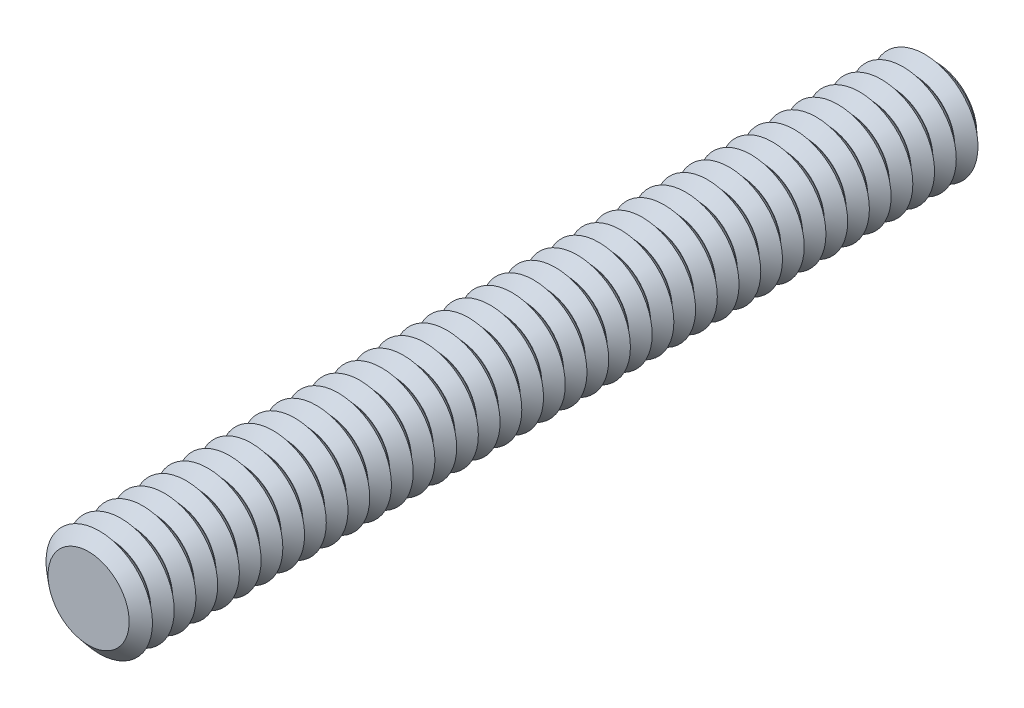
ISO-10303-21;
HEADER;
FILE_DESCRIPTION(('STEP AP214'),'2;1');
FILE_NAME('part.step','',(''),(''),'','','');
FILE_SCHEMA(('AUTOMOTIVE_DESIGN { 1 0 10303 214 1 1 1 1 }'));
ENDSEC;
DATA;
#1=APPLICATION_CONTEXT('core data for automotive mechanical design processes');
#2=APPLICATION_PROTOCOL_DEFINITION('international standard','automotive_design',2000,#1);
#3=PRODUCT_CONTEXT('',#1,'mechanical');
#4=PRODUCT('Part','Part','',(#3));
#5=PRODUCT_RELATED_PRODUCT_CATEGORY('part','',(#4));
#6=PRODUCT_DEFINITION_FORMATION('','',#4);
#7=PRODUCT_DEFINITION_CONTEXT('part definition',#1,'design');
#8=PRODUCT_DEFINITION('design','',#6,#7);
#9=PRODUCT_DEFINITION_SHAPE('','',#8);
#10=(LENGTH_UNIT() NAMED_UNIT(*) SI_UNIT(.MILLI.,.METRE.));
#11=(NAMED_UNIT(*) PLANE_ANGLE_UNIT() SI_UNIT($,.RADIAN.));
#12=(NAMED_UNIT(*) SI_UNIT($,.STERADIAN.) SOLID_ANGLE_UNIT());
#13=UNCERTAINTY_MEASURE_WITH_UNIT(LENGTH_MEASURE(1.E-05),#10,'distance_accuracy_value','');
#14=(GEOMETRIC_REPRESENTATION_CONTEXT(3) GLOBAL_UNCERTAINTY_ASSIGNED_CONTEXT((#13)) GLOBAL_UNIT_ASSIGNED_CONTEXT((#10,
#11,#12)) REPRESENTATION_CONTEXT('',''));
#15=CARTESIAN_POINT('',(0.,0.,0.));
#16=DIRECTION('',(0.,0.,1.));
#17=DIRECTION('',(1.,0.,0.));
#18=AXIS2_PLACEMENT_3D('',#15,#16,#17);
#19=CARTESIAN_POINT('',(0.,0.,-50.546));
#20=DIRECTION('',(0.,0.,1.));
#21=DIRECTION('',(1.,0.,0.));
#22=AXIS2_PLACEMENT_3D('',#19,#20,#21);
#23=CYLINDRICAL_SURFACE('',#22,2.41935);
#24=CARTESIAN_POINT('',(0.,0.,-49.2252));
#25=DIRECTION('',(0.,0.,-1.));
#26=DIRECTION('',(-1.,0.,0.));
#27=AXIS2_PLACEMENT_3D('',#24,#25,#26);
#28=CIRCLE('',#27,2.41935);
#29=CARTESIAN_POINT('',(-2.41935,0.,-49.2252));
#30=VERTEX_POINT('',#29);
#31=EDGE_CURVE('E10',#30,#30,#28,.T.);
#32=ORIENTED_EDGE('',*,*,#31,.F.);
#33=EDGE_LOOP('',(#32));
#34=FACE_BOUND('',#33,.T.);
#35=CARTESIAN_POINT('',(0.,0.,-49.1998));
#36=DIRECTION('',(0.,0.,1.));
#37=DIRECTION('',(1.,0.,0.));
#38=AXIS2_PLACEMENT_3D('',#35,#36,#37);
#39=CIRCLE('',#38,2.41935);
#40=CARTESIAN_POINT('',(2.41935,0.,-49.1998));
#41=VERTEX_POINT('',#40);
#42=EDGE_CURVE('E51',#41,#41,#39,.T.);
#43=ORIENTED_EDGE('',*,*,#42,.F.);
#44=EDGE_LOOP('',(#43));
#45=FACE_BOUND('',#44,.T.);
#46=ADVANCED_FACE('F36',(#34,#45),#23,.T.);
#47=CARTESIAN_POINT('',(0.,0.,-47.9298));
#48=DIRECTION('',(0.,0.,-1.));
#49=DIRECTION('',(-1.,0.,0.));
#50=AXIS2_PLACEMENT_3D('',#47,#48,#49);
#51=CIRCLE('',#50,2.41935);
#52=CARTESIAN_POINT('',(-2.41935,0.,-47.9298));
#53=VERTEX_POINT('',#52);
#54=EDGE_CURVE('E47',#53,#53,#51,.T.);
#55=ORIENTED_EDGE('',*,*,#54,.F.);
#56=EDGE_LOOP('',(#55));
#57=FACE_BOUND('',#56,.T.);
#58=CARTESIAN_POINT('',(0.,0.,-47.9044));
#59=DIRECTION('',(0.,0.,1.));
#60=DIRECTION('',(1.,0.,0.));
#61=AXIS2_PLACEMENT_3D('',#58,#59,#60);
#62=CIRCLE('',#61,2.41935);
#63=CARTESIAN_POINT('',(2.41935,0.,-47.9044));
#64=VERTEX_POINT('',#63);
#65=EDGE_CURVE('E59',#64,#64,#62,.T.);
#66=ORIENTED_EDGE('',*,*,#65,.F.);
#67=EDGE_LOOP('',(#66));
#68=FACE_BOUND('',#67,.T.);
#69=ADVANCED_FACE('F415',(#57,#68),#23,.T.);
#70=CARTESIAN_POINT('',(0.,0.,-46.6344));
#71=DIRECTION('',(0.,0.,-1.));
#72=DIRECTION('',(-1.,0.,0.));
#73=AXIS2_PLACEMENT_3D('',#70,#71,#72);
#74=CIRCLE('',#73,2.41935);
#75=CARTESIAN_POINT('',(-2.41935,0.,-46.6344));
#76=VERTEX_POINT('',#75);
#77=EDGE_CURVE('E56',#76,#76,#74,.T.);
#78=ORIENTED_EDGE('',*,*,#77,.F.);
#79=EDGE_LOOP('',(#78));
#80=FACE_BOUND('',#79,.T.);
#81=CARTESIAN_POINT('',(0.,0.,-46.609));
#82=DIRECTION('',(0.,0.,1.));
#83=DIRECTION('',(1.,0.,0.));
#84=AXIS2_PLACEMENT_3D('',#81,#82,#83);
#85=CIRCLE('',#84,2.41935);
#86=CARTESIAN_POINT('',(2.41935,0.,-46.609));
#87=VERTEX_POINT('',#86);
#88=EDGE_CURVE('E65',#87,#87,#85,.T.);
#89=ORIENTED_EDGE('',*,*,#88,.F.);
#90=EDGE_LOOP('',(#89));
#91=FACE_BOUND('',#90,.T.);
#92=ADVANCED_FACE('F420',(#80,#91),#23,.T.);
#93=CARTESIAN_POINT('',(0.,0.,-45.339));
#94=DIRECTION('',(0.,0.,-1.));
#95=DIRECTION('',(-1.,0.,0.));
#96=AXIS2_PLACEMENT_3D('',#93,#94,#95);
#97=CIRCLE('',#96,2.41935);
#98=CARTESIAN_POINT('',(-2.41935,0.,-45.339));
#99=VERTEX_POINT('',#98);
#100=EDGE_CURVE('E62',#99,#99,#97,.T.);
#101=ORIENTED_EDGE('',*,*,#100,.F.);
#102=EDGE_LOOP('',(#101));
#103=FACE_BOUND('',#102,.T.);
#104=CARTESIAN_POINT('',(0.,0.,-45.3136));
#105=DIRECTION('',(0.,0.,1.));
#106=DIRECTION('',(1.,0.,0.));
#107=AXIS2_PLACEMENT_3D('',#104,#105,#106);
#108=CIRCLE('',#107,2.41935);
#109=CARTESIAN_POINT('',(2.41935,0.,-45.3136));
#110=VERTEX_POINT('',#109);
#111=EDGE_CURVE('E71',#110,#110,#108,.T.);
#112=ORIENTED_EDGE('',*,*,#111,.F.);
#113=EDGE_LOOP('',(#112));
#114=FACE_BOUND('',#113,.T.);
#115=ADVANCED_FACE('F1066',(#103,#114),#23,.T.);
#116=CARTESIAN_POINT('',(0.,0.,-44.0436));
#117=DIRECTION('',(0.,0.,-1.));
#118=DIRECTION('',(-1.,0.,0.));
#119=AXIS2_PLACEMENT_3D('',#116,#117,#118);
#120=CIRCLE('',#119,2.41935);
#121=CARTESIAN_POINT('',(-2.41935,0.,-44.0436));
#122=VERTEX_POINT('',#121);
#123=EDGE_CURVE('E68',#122,#122,#120,.T.);
#124=ORIENTED_EDGE('',*,*,#123,.F.);
#125=EDGE_LOOP('',(#124));
#126=FACE_BOUND('',#125,.T.);
#127=CARTESIAN_POINT('',(0.,0.,-44.0182));
#128=DIRECTION('',(0.,0.,1.));
#129=DIRECTION('',(1.,0.,0.));
#130=AXIS2_PLACEMENT_3D('',#127,#128,#129);
#131=CIRCLE('',#130,2.41935);
#132=CARTESIAN_POINT('',(2.41935,0.,-44.0182));
#133=VERTEX_POINT('',#132);
#134=EDGE_CURVE('E77',#133,#133,#131,.T.);
#135=ORIENTED_EDGE('',*,*,#134,.F.);
#136=EDGE_LOOP('',(#135));
#137=FACE_BOUND('',#136,.T.);
#138=ADVANCED_FACE('F1058',(#126,#137),#23,.T.);
#139=CARTESIAN_POINT('',(0.,0.,-42.7482));
#140=DIRECTION('',(0.,0.,-1.));
#141=DIRECTION('',(-1.,0.,0.));
#142=AXIS2_PLACEMENT_3D('',#139,#140,#141);
#143=CIRCLE('',#142,2.41935);
#144=CARTESIAN_POINT('',(-2.41935,0.,-42.7482));
#145=VERTEX_POINT('',#144);
#146=EDGE_CURVE('E74',#145,#145,#143,.T.);
#147=ORIENTED_EDGE('',*,*,#146,.F.);
#148=EDGE_LOOP('',(#147));
#149=FACE_BOUND('',#148,.T.);
#150=CARTESIAN_POINT('',(0.,0.,-42.7228000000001));
#151=DIRECTION('',(0.,0.,1.));
#152=DIRECTION('',(1.,0.,0.));
#153=AXIS2_PLACEMENT_3D('',#150,#151,#152);
#154=CIRCLE('',#153,2.41935);
#155=CARTESIAN_POINT('',(2.41935,0.,-42.7228000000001));
#156=VERTEX_POINT('',#155);
#157=EDGE_CURVE('E83',#156,#156,#154,.T.);
#158=ORIENTED_EDGE('',*,*,#157,.F.);
#159=EDGE_LOOP('',(#158));
#160=FACE_BOUND('',#159,.T.);
#161=ADVANCED_FACE('F1050',(#149,#160),#23,.T.);
#162=CARTESIAN_POINT('',(0.,0.,-41.4528));
#163=DIRECTION('',(0.,0.,-1.));
#164=DIRECTION('',(-1.,0.,0.));
#165=AXIS2_PLACEMENT_3D('',#162,#163,#164);
#166=CIRCLE('',#165,2.41935);
#167=CARTESIAN_POINT('',(-2.41935,0.,-41.4528));
#168=VERTEX_POINT('',#167);
#169=EDGE_CURVE('E80',#168,#168,#166,.T.);
#170=ORIENTED_EDGE('',*,*,#169,.F.);
#171=EDGE_LOOP('',(#170));
#172=FACE_BOUND('',#171,.T.);
#173=CARTESIAN_POINT('',(0.,0.,-41.4274));
#174=DIRECTION('',(0.,0.,1.));
#175=DIRECTION('',(1.,0.,0.));
#176=AXIS2_PLACEMENT_3D('',#173,#174,#175);
#177=CIRCLE('',#176,2.41935);
#178=CARTESIAN_POINT('',(2.41935,0.,-41.4274));
#179=VERTEX_POINT('',#178);
#180=EDGE_CURVE('E89',#179,#179,#177,.T.);
#181=ORIENTED_EDGE('',*,*,#180,.F.);
#182=EDGE_LOOP('',(#181));
#183=FACE_BOUND('',#182,.T.);
#184=ADVANCED_FACE('F1042',(#172,#183),#23,.T.);
#185=CARTESIAN_POINT('',(0.,0.,-40.1574));
#186=DIRECTION('',(0.,0.,-1.));
#187=DIRECTION('',(-1.,0.,0.));
#188=AXIS2_PLACEMENT_3D('',#185,#186,#187);
#189=CIRCLE('',#188,2.41935);
#190=CARTESIAN_POINT('',(-2.41935,0.,-40.1574));
#191=VERTEX_POINT('',#190);
#192=EDGE_CURVE('E86',#191,#191,#189,.T.);
#193=ORIENTED_EDGE('',*,*,#192,.F.);
#194=EDGE_LOOP('',(#193));
#195=FACE_BOUND('',#194,.T.);
#196=CARTESIAN_POINT('',(0.,0.,-40.1319999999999));
#197=DIRECTION('',(0.,0.,1.));
#198=DIRECTION('',(1.,0.,0.));
#199=AXIS2_PLACEMENT_3D('',#196,#197,#198);
#200=CIRCLE('',#199,2.41935);
#201=CARTESIAN_POINT('',(2.41935,0.,-40.1319999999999));
#202=VERTEX_POINT('',#201);
#203=EDGE_CURVE('E95',#202,#202,#200,.T.);
#204=ORIENTED_EDGE('',*,*,#203,.F.);
#205=EDGE_LOOP('',(#204));
#206=FACE_BOUND('',#205,.T.);
#207=ADVANCED_FACE('F1034',(#195,#206),#23,.T.);
#208=CARTESIAN_POINT('',(0.,0.,-38.8620000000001));
#209=DIRECTION('',(0.,0.,-1.));
#210=DIRECTION('',(-1.,0.,0.));
#211=AXIS2_PLACEMENT_3D('',#208,#209,#210);
#212=CIRCLE('',#211,2.41935);
#213=CARTESIAN_POINT('',(-2.41935,0.,-38.8620000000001));
#214=VERTEX_POINT('',#213);
#215=EDGE_CURVE('E92',#214,#214,#212,.T.);
#216=ORIENTED_EDGE('',*,*,#215,.F.);
#217=EDGE_LOOP('',(#216));
#218=FACE_BOUND('',#217,.T.);
#219=CARTESIAN_POINT('',(0.,0.,-38.8366));
#220=DIRECTION('',(0.,0.,1.));
#221=DIRECTION('',(1.,0.,0.));
#222=AXIS2_PLACEMENT_3D('',#219,#220,#221);
#223=CIRCLE('',#222,2.41935);
#224=CARTESIAN_POINT('',(2.41935,0.,-38.8366));
#225=VERTEX_POINT('',#224);
#226=EDGE_CURVE('E101',#225,#225,#223,.T.);
#227=ORIENTED_EDGE('',*,*,#226,.F.);
#228=EDGE_LOOP('',(#227));
#229=FACE_BOUND('',#228,.T.);
#230=ADVANCED_FACE('F1026',(#218,#229),#23,.T.);
#231=CARTESIAN_POINT('',(0.,0.,-37.5666));
#232=DIRECTION('',(0.,0.,-1.));
#233=DIRECTION('',(-1.,0.,0.));
#234=AXIS2_PLACEMENT_3D('',#231,#232,#233);
#235=CIRCLE('',#234,2.41935);
#236=CARTESIAN_POINT('',(-2.41935,0.,-37.5666));
#237=VERTEX_POINT('',#236);
#238=EDGE_CURVE('E98',#237,#237,#235,.T.);
#239=ORIENTED_EDGE('',*,*,#238,.F.);
#240=EDGE_LOOP('',(#239));
#241=FACE_BOUND('',#240,.T.);
#242=CARTESIAN_POINT('',(0.,0.,-37.5412000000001));
#243=DIRECTION('',(0.,0.,1.));
#244=DIRECTION('',(1.,0.,0.));
#245=AXIS2_PLACEMENT_3D('',#242,#243,#244);
#246=CIRCLE('',#245,2.41935);
#247=CARTESIAN_POINT('',(2.41935,0.,-37.5412000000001));
#248=VERTEX_POINT('',#247);
#249=EDGE_CURVE('E107',#248,#248,#246,.T.);
#250=ORIENTED_EDGE('',*,*,#249,.F.);
#251=EDGE_LOOP('',(#250));
#252=FACE_BOUND('',#251,.T.);
#253=ADVANCED_FACE('F1018',(#241,#252),#23,.T.);
#254=CARTESIAN_POINT('',(0.,0.,-36.2712));
#255=DIRECTION('',(0.,0.,-1.));
#256=DIRECTION('',(-1.,0.,0.));
#257=AXIS2_PLACEMENT_3D('',#254,#255,#256);
#258=CIRCLE('',#257,2.41935);
#259=CARTESIAN_POINT('',(-2.41935,0.,-36.2712));
#260=VERTEX_POINT('',#259);
#261=EDGE_CURVE('E104',#260,#260,#258,.T.);
#262=ORIENTED_EDGE('',*,*,#261,.F.);
#263=EDGE_LOOP('',(#262));
#264=FACE_BOUND('',#263,.T.);
#265=CARTESIAN_POINT('',(0.,0.,-36.2458));
#266=DIRECTION('',(0.,0.,1.));
#267=DIRECTION('',(1.,0.,0.));
#268=AXIS2_PLACEMENT_3D('',#265,#266,#267);
#269=CIRCLE('',#268,2.41935);
#270=CARTESIAN_POINT('',(2.41935,0.,-36.2458));
#271=VERTEX_POINT('',#270);
#272=EDGE_CURVE('E113',#271,#271,#269,.T.);
#273=ORIENTED_EDGE('',*,*,#272,.F.);
#274=EDGE_LOOP('',(#273));
#275=FACE_BOUND('',#274,.T.);
#276=ADVANCED_FACE('F1010',(#264,#275),#23,.T.);
#277=CARTESIAN_POINT('',(0.,0.,-34.9758));
#278=DIRECTION('',(0.,0.,-1.));
#279=DIRECTION('',(-1.,0.,0.));
#280=AXIS2_PLACEMENT_3D('',#277,#278,#279);
#281=CIRCLE('',#280,2.41935);
#282=CARTESIAN_POINT('',(-2.41935,0.,-34.9758));
#283=VERTEX_POINT('',#282);
#284=EDGE_CURVE('E110',#283,#283,#281,.T.);
#285=ORIENTED_EDGE('',*,*,#284,.F.);
#286=EDGE_LOOP('',(#285));
#287=FACE_BOUND('',#286,.T.);
#288=CARTESIAN_POINT('',(0.,0.,-34.9503999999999));
#289=DIRECTION('',(0.,0.,1.));
#290=DIRECTION('',(1.,0.,0.));
#291=AXIS2_PLACEMENT_3D('',#288,#289,#290);
#292=CIRCLE('',#291,2.41935);
#293=CARTESIAN_POINT('',(2.41935,0.,-34.9503999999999));
#294=VERTEX_POINT('',#293);
#295=EDGE_CURVE('E119',#294,#294,#292,.T.);
#296=ORIENTED_EDGE('',*,*,#295,.F.);
#297=EDGE_LOOP('',(#296));
#298=FACE_BOUND('',#297,.T.);
#299=ADVANCED_FACE('F1002',(#287,#298),#23,.T.);
#300=CARTESIAN_POINT('',(0.,0.,-33.6804000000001));
#301=DIRECTION('',(0.,0.,-1.));
#302=DIRECTION('',(-1.,0.,0.));
#303=AXIS2_PLACEMENT_3D('',#300,#301,#302);
#304=CIRCLE('',#303,2.41935);
#305=CARTESIAN_POINT('',(-2.41935,0.,-33.6804000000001));
#306=VERTEX_POINT('',#305);
#307=EDGE_CURVE('E116',#306,#306,#304,.T.);
#308=ORIENTED_EDGE('',*,*,#307,.F.);
#309=EDGE_LOOP('',(#308));
#310=FACE_BOUND('',#309,.T.);
#311=CARTESIAN_POINT('',(0.,0.,-33.655));
#312=DIRECTION('',(0.,0.,1.));
#313=DIRECTION('',(1.,0.,0.));
#314=AXIS2_PLACEMENT_3D('',#311,#312,#313);
#315=CIRCLE('',#314,2.41935);
#316=CARTESIAN_POINT('',(2.41935,0.,-33.655));
#317=VERTEX_POINT('',#316);
#318=EDGE_CURVE('E125',#317,#317,#315,.T.);
#319=ORIENTED_EDGE('',*,*,#318,.F.);
#320=EDGE_LOOP('',(#319));
#321=FACE_BOUND('',#320,.T.);
#322=ADVANCED_FACE('F994',(#310,#321),#23,.T.);
#323=CARTESIAN_POINT('',(0.,0.,-32.385));
#324=DIRECTION('',(0.,0.,-1.));
#325=DIRECTION('',(-1.,0.,0.));
#326=AXIS2_PLACEMENT_3D('',#323,#324,#325);
#327=CIRCLE('',#326,2.41935);
#328=CARTESIAN_POINT('',(-2.41935,0.,-32.385));
#329=VERTEX_POINT('',#328);
#330=EDGE_CURVE('E122',#329,#329,#327,.T.);
#331=ORIENTED_EDGE('',*,*,#330,.F.);
#332=EDGE_LOOP('',(#331));
#333=FACE_BOUND('',#332,.T.);
#334=CARTESIAN_POINT('',(0.,0.,-32.3596));
#335=DIRECTION('',(0.,0.,1.));
#336=DIRECTION('',(1.,0.,0.));
#337=AXIS2_PLACEMENT_3D('',#334,#335,#336);
#338=CIRCLE('',#337,2.41935);
#339=CARTESIAN_POINT('',(2.41935,0.,-32.3596));
#340=VERTEX_POINT('',#339);
#341=EDGE_CURVE('E131',#340,#340,#338,.T.);
#342=ORIENTED_EDGE('',*,*,#341,.F.);
#343=EDGE_LOOP('',(#342));
#344=FACE_BOUND('',#343,.T.);
#345=ADVANCED_FACE('F986',(#333,#344),#23,.T.);
#346=CARTESIAN_POINT('',(0.,0.,-31.0895999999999));
#347=DIRECTION('',(0.,0.,-1.));
#348=DIRECTION('',(-1.,0.,0.));
#349=AXIS2_PLACEMENT_3D('',#346,#347,#348);
#350=CIRCLE('',#349,2.41935);
#351=CARTESIAN_POINT('',(-2.41935,0.,-31.0895999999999));
#352=VERTEX_POINT('',#351);
#353=EDGE_CURVE('E128',#352,#352,#350,.T.);
#354=ORIENTED_EDGE('',*,*,#353,.F.);
#355=EDGE_LOOP('',(#354));
#356=FACE_BOUND('',#355,.T.);
#357=CARTESIAN_POINT('',(0.,0.,-31.0642));
#358=DIRECTION('',(0.,0.,1.));
#359=DIRECTION('',(1.,0.,0.));
#360=AXIS2_PLACEMENT_3D('',#357,#358,#359);
#361=CIRCLE('',#360,2.41935);
#362=CARTESIAN_POINT('',(2.41935,0.,-31.0642));
#363=VERTEX_POINT('',#362);
#364=EDGE_CURVE('E137',#363,#363,#361,.T.);
#365=ORIENTED_EDGE('',*,*,#364,.F.);
#366=EDGE_LOOP('',(#365));
#367=FACE_BOUND('',#366,.T.);
#368=ADVANCED_FACE('F978',(#356,#367),#23,.T.);
#369=CARTESIAN_POINT('',(0.,0.,-29.7942));
#370=DIRECTION('',(0.,0.,-1.));
#371=DIRECTION('',(-1.,0.,0.));
#372=AXIS2_PLACEMENT_3D('',#369,#370,#371);
#373=CIRCLE('',#372,2.41935);
#374=CARTESIAN_POINT('',(-2.41935,0.,-29.7942));
#375=VERTEX_POINT('',#374);
#376=EDGE_CURVE('E134',#375,#375,#373,.T.);
#377=ORIENTED_EDGE('',*,*,#376,.F.);
#378=EDGE_LOOP('',(#377));
#379=FACE_BOUND('',#378,.T.);
#380=CARTESIAN_POINT('',(0.,0.,-29.7687999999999));
#381=DIRECTION('',(0.,0.,1.));
#382=DIRECTION('',(1.,0.,0.));
#383=AXIS2_PLACEMENT_3D('',#380,#381,#382);
#384=CIRCLE('',#383,2.41935);
#385=CARTESIAN_POINT('',(2.41935,0.,-29.7687999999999));
#386=VERTEX_POINT('',#385);
#387=EDGE_CURVE('E143',#386,#386,#384,.T.);
#388=ORIENTED_EDGE('',*,*,#387,.F.);
#389=EDGE_LOOP('',(#388));
#390=FACE_BOUND('',#389,.T.);
#391=ADVANCED_FACE('F970',(#379,#390),#23,.T.);
#392=CARTESIAN_POINT('',(0.,0.,-28.4988));
#393=DIRECTION('',(0.,0.,-1.));
#394=DIRECTION('',(-1.,0.,0.));
#395=AXIS2_PLACEMENT_3D('',#392,#393,#394);
#396=CIRCLE('',#395,2.41935);
#397=CARTESIAN_POINT('',(-2.41935,0.,-28.4988));
#398=VERTEX_POINT('',#397);
#399=EDGE_CURVE('E140',#398,#398,#396,.T.);
#400=ORIENTED_EDGE('',*,*,#399,.F.);
#401=EDGE_LOOP('',(#400));
#402=FACE_BOUND('',#401,.T.);
#403=CARTESIAN_POINT('',(0.,0.,-28.4734));
#404=DIRECTION('',(0.,0.,1.));
#405=DIRECTION('',(1.,0.,0.));
#406=AXIS2_PLACEMENT_3D('',#403,#404,#405);
#407=CIRCLE('',#406,2.41935);
#408=CARTESIAN_POINT('',(2.41935,0.,-28.4734));
#409=VERTEX_POINT('',#408);
#410=EDGE_CURVE('E149',#409,#409,#407,.T.);
#411=ORIENTED_EDGE('',*,*,#410,.F.);
#412=EDGE_LOOP('',(#411));
#413=FACE_BOUND('',#412,.T.);
#414=ADVANCED_FACE('F962',(#402,#413),#23,.T.);
#415=CARTESIAN_POINT('',(0.,0.,-27.2034));
#416=DIRECTION('',(0.,0.,-1.));
#417=DIRECTION('',(-1.,0.,0.));
#418=AXIS2_PLACEMENT_3D('',#415,#416,#417);
#419=CIRCLE('',#418,2.41935);
#420=CARTESIAN_POINT('',(-2.41935,0.,-27.2034));
#421=VERTEX_POINT('',#420);
#422=EDGE_CURVE('E146',#421,#421,#419,.T.);
#423=ORIENTED_EDGE('',*,*,#422,.F.);
#424=EDGE_LOOP('',(#423));
#425=FACE_BOUND('',#424,.T.);
#426=CARTESIAN_POINT('',(0.,0.,-27.178));
#427=DIRECTION('',(0.,0.,1.));
#428=DIRECTION('',(1.,0.,0.));
#429=AXIS2_PLACEMENT_3D('',#426,#427,#428);
#430=CIRCLE('',#429,2.41935);
#431=CARTESIAN_POINT('',(2.41935,0.,-27.178));
#432=VERTEX_POINT('',#431);
#433=EDGE_CURVE('E155',#432,#432,#430,.T.);
#434=ORIENTED_EDGE('',*,*,#433,.F.);
#435=EDGE_LOOP('',(#434));
#436=FACE_BOUND('',#435,.T.);
#437=ADVANCED_FACE('F954',(#425,#436),#23,.T.);
#438=CARTESIAN_POINT('',(0.,0.,-25.9079999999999));
#439=DIRECTION('',(0.,0.,-1.));
#440=DIRECTION('',(-1.,0.,0.));
#441=AXIS2_PLACEMENT_3D('',#438,#439,#440);
#442=CIRCLE('',#441,2.41935);
#443=CARTESIAN_POINT('',(-2.41935,0.,-25.9079999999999));
#444=VERTEX_POINT('',#443);
#445=EDGE_CURVE('E152',#444,#444,#442,.T.);
#446=ORIENTED_EDGE('',*,*,#445,.F.);
#447=EDGE_LOOP('',(#446));
#448=FACE_BOUND('',#447,.T.);
#449=CARTESIAN_POINT('',(0.,0.,-25.8826));
#450=DIRECTION('',(0.,0.,1.));
#451=DIRECTION('',(1.,0.,0.));
#452=AXIS2_PLACEMENT_3D('',#449,#450,#451);
#453=CIRCLE('',#452,2.41935);
#454=CARTESIAN_POINT('',(2.41935,0.,-25.8826));
#455=VERTEX_POINT('',#454);
#456=EDGE_CURVE('E161',#455,#455,#453,.T.);
#457=ORIENTED_EDGE('',*,*,#456,.F.);
#458=EDGE_LOOP('',(#457));
#459=FACE_BOUND('',#458,.T.);
#460=ADVANCED_FACE('F946',(#448,#459),#23,.T.);
#461=CARTESIAN_POINT('',(0.,0.,-24.6126));
#462=DIRECTION('',(0.,0.,-1.));
#463=DIRECTION('',(-1.,0.,0.));
#464=AXIS2_PLACEMENT_3D('',#461,#462,#463);
#465=CIRCLE('',#464,2.41935);
#466=CARTESIAN_POINT('',(-2.41935,0.,-24.6126));
#467=VERTEX_POINT('',#466);
#468=EDGE_CURVE('E158',#467,#467,#465,.T.);
#469=ORIENTED_EDGE('',*,*,#468,.F.);
#470=EDGE_LOOP('',(#469));
#471=FACE_BOUND('',#470,.T.);
#472=CARTESIAN_POINT('',(0.,0.,-24.5872));
#473=DIRECTION('',(0.,0.,1.));
#474=DIRECTION('',(1.,0.,0.));
#475=AXIS2_PLACEMENT_3D('',#472,#473,#474);
#476=CIRCLE('',#475,2.41935);
#477=CARTESIAN_POINT('',(2.41935,0.,-24.5872));
#478=VERTEX_POINT('',#477);
#479=EDGE_CURVE('E167',#478,#478,#476,.T.);
#480=ORIENTED_EDGE('',*,*,#479,.F.);
#481=EDGE_LOOP('',(#480));
#482=FACE_BOUND('',#481,.T.);
#483=ADVANCED_FACE('F938',(#471,#482),#23,.T.);
#484=CARTESIAN_POINT('',(0.,0.,-23.3172));
#485=DIRECTION('',(0.,0.,-1.));
#486=DIRECTION('',(-1.,0.,0.));
#487=AXIS2_PLACEMENT_3D('',#484,#485,#486);
#488=CIRCLE('',#487,2.41935);
#489=CARTESIAN_POINT('',(-2.41935,0.,-23.3172));
#490=VERTEX_POINT('',#489);
#491=EDGE_CURVE('E164',#490,#490,#488,.T.);
#492=ORIENTED_EDGE('',*,*,#491,.F.);
#493=EDGE_LOOP('',(#492));
#494=FACE_BOUND('',#493,.T.);
#495=CARTESIAN_POINT('',(0.,0.,-23.2918));
#496=DIRECTION('',(0.,0.,1.));
#497=DIRECTION('',(1.,0.,0.));
#498=AXIS2_PLACEMENT_3D('',#495,#496,#497);
#499=CIRCLE('',#498,2.41935);
#500=CARTESIAN_POINT('',(2.41935,0.,-23.2918));
#501=VERTEX_POINT('',#500);
#502=EDGE_CURVE('E173',#501,#501,#499,.T.);
#503=ORIENTED_EDGE('',*,*,#502,.F.);
#504=EDGE_LOOP('',(#503));
#505=FACE_BOUND('',#504,.T.);
#506=ADVANCED_FACE('F930',(#494,#505),#23,.T.);
#507=CARTESIAN_POINT('',(0.,0.,-22.0218));
#508=DIRECTION('',(0.,0.,-1.));
#509=DIRECTION('',(-1.,0.,0.));
#510=AXIS2_PLACEMENT_3D('',#507,#508,#509);
#511=CIRCLE('',#510,2.41935);
#512=CARTESIAN_POINT('',(-2.41935,0.,-22.0218));
#513=VERTEX_POINT('',#512);
#514=EDGE_CURVE('E170',#513,#513,#511,.T.);
#515=ORIENTED_EDGE('',*,*,#514,.F.);
#516=EDGE_LOOP('',(#515));
#517=FACE_BOUND('',#516,.T.);
#518=CARTESIAN_POINT('',(0.,0.,-21.9964));
#519=DIRECTION('',(0.,0.,1.));
#520=DIRECTION('',(1.,0.,0.));
#521=AXIS2_PLACEMENT_3D('',#518,#519,#520);
#522=CIRCLE('',#521,2.41935);
#523=CARTESIAN_POINT('',(2.41935,0.,-21.9964));
#524=VERTEX_POINT('',#523);
#525=EDGE_CURVE('E179',#524,#524,#522,.T.);
#526=ORIENTED_EDGE('',*,*,#525,.F.);
#527=EDGE_LOOP('',(#526));
#528=FACE_BOUND('',#527,.T.);
#529=ADVANCED_FACE('F922',(#517,#528),#23,.T.);
#530=CARTESIAN_POINT('',(0.,0.,-20.7263999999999));
#531=DIRECTION('',(0.,0.,-1.));
#532=DIRECTION('',(-1.,0.,0.));
#533=AXIS2_PLACEMENT_3D('',#530,#531,#532);
#534=CIRCLE('',#533,2.41935);
#535=CARTESIAN_POINT('',(-2.41935,0.,-20.7263999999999));
#536=VERTEX_POINT('',#535);
#537=EDGE_CURVE('E176',#536,#536,#534,.T.);
#538=ORIENTED_EDGE('',*,*,#537,.F.);
#539=EDGE_LOOP('',(#538));
#540=FACE_BOUND('',#539,.T.);
#541=CARTESIAN_POINT('',(0.,0.,-20.701));
#542=DIRECTION('',(0.,0.,1.));
#543=DIRECTION('',(1.,0.,0.));
#544=AXIS2_PLACEMENT_3D('',#541,#542,#543);
#545=CIRCLE('',#544,2.41935);
#546=CARTESIAN_POINT('',(2.41935,0.,-20.701));
#547=VERTEX_POINT('',#546);
#548=EDGE_CURVE('E185',#547,#547,#545,.T.);
#549=ORIENTED_EDGE('',*,*,#548,.F.);
#550=EDGE_LOOP('',(#549));
#551=FACE_BOUND('',#550,.T.);
#552=ADVANCED_FACE('F914',(#540,#551),#23,.T.);
#553=CARTESIAN_POINT('',(0.,0.,-19.431));
#554=DIRECTION('',(0.,0.,-1.));
#555=DIRECTION('',(-1.,0.,0.));
#556=AXIS2_PLACEMENT_3D('',#553,#554,#555);
#557=CIRCLE('',#556,2.41935);
#558=CARTESIAN_POINT('',(-2.41935,0.,-19.431));
#559=VERTEX_POINT('',#558);
#560=EDGE_CURVE('E182',#559,#559,#557,.T.);
#561=ORIENTED_EDGE('',*,*,#560,.F.);
#562=EDGE_LOOP('',(#561));
#563=FACE_BOUND('',#562,.T.);
#564=CARTESIAN_POINT('',(0.,0.,-19.4056));
#565=DIRECTION('',(0.,0.,1.));
#566=DIRECTION('',(1.,0.,0.));
#567=AXIS2_PLACEMENT_3D('',#564,#565,#566);
#568=CIRCLE('',#567,2.41935);
#569=CARTESIAN_POINT('',(2.41935,0.,-19.4056));
#570=VERTEX_POINT('',#569);
#571=EDGE_CURVE('E191',#570,#570,#568,.T.);
#572=ORIENTED_EDGE('',*,*,#571,.F.);
#573=EDGE_LOOP('',(#572));
#574=FACE_BOUND('',#573,.T.);
#575=ADVANCED_FACE('F906',(#563,#574),#23,.T.);
#576=CARTESIAN_POINT('',(0.,0.,-18.1356));
#577=DIRECTION('',(0.,0.,-1.));
#578=DIRECTION('',(-1.,0.,0.));
#579=AXIS2_PLACEMENT_3D('',#576,#577,#578);
#580=CIRCLE('',#579,2.41935);
#581=CARTESIAN_POINT('',(-2.41935,0.,-18.1356));
#582=VERTEX_POINT('',#581);
#583=EDGE_CURVE('E188',#582,#582,#580,.T.);
#584=ORIENTED_EDGE('',*,*,#583,.F.);
#585=EDGE_LOOP('',(#584));
#586=FACE_BOUND('',#585,.T.);
#587=CARTESIAN_POINT('',(0.,0.,-18.1102000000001));
#588=DIRECTION('',(0.,0.,1.));
#589=DIRECTION('',(1.,0.,0.));
#590=AXIS2_PLACEMENT_3D('',#587,#588,#589);
#591=CIRCLE('',#590,2.41935);
#592=CARTESIAN_POINT('',(2.41935,0.,-18.1102000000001));
#593=VERTEX_POINT('',#592);
#594=EDGE_CURVE('E197',#593,#593,#591,.T.);
#595=ORIENTED_EDGE('',*,*,#594,.F.);
#596=EDGE_LOOP('',(#595));
#597=FACE_BOUND('',#596,.T.);
#598=ADVANCED_FACE('F898',(#586,#597),#23,.T.);
#599=CARTESIAN_POINT('',(0.,0.,-16.8402));
#600=DIRECTION('',(0.,0.,-1.));
#601=DIRECTION('',(-1.,0.,0.));
#602=AXIS2_PLACEMENT_3D('',#599,#600,#601);
#603=CIRCLE('',#602,2.41935);
#604=CARTESIAN_POINT('',(-2.41935,0.,-16.8402));
#605=VERTEX_POINT('',#604);
#606=EDGE_CURVE('E194',#605,#605,#603,.T.);
#607=ORIENTED_EDGE('',*,*,#606,.F.);
#608=EDGE_LOOP('',(#607));
#609=FACE_BOUND('',#608,.T.);
#610=CARTESIAN_POINT('',(0.,0.,-16.8148));
#611=DIRECTION('',(0.,0.,1.));
#612=DIRECTION('',(1.,0.,0.));
#613=AXIS2_PLACEMENT_3D('',#610,#611,#612);
#614=CIRCLE('',#613,2.41935);
#615=CARTESIAN_POINT('',(2.41935,0.,-16.8148));
#616=VERTEX_POINT('',#615);
#617=EDGE_CURVE('E203',#616,#616,#614,.T.);
#618=ORIENTED_EDGE('',*,*,#617,.F.);
#619=EDGE_LOOP('',(#618));
#620=FACE_BOUND('',#619,.T.);
#621=ADVANCED_FACE('F890',(#609,#620),#23,.T.);
#622=CARTESIAN_POINT('',(0.,0.,-15.5448));
#623=DIRECTION('',(0.,0.,-1.));
#624=DIRECTION('',(-1.,0.,0.));
#625=AXIS2_PLACEMENT_3D('',#622,#623,#624);
#626=CIRCLE('',#625,2.41935);
#627=CARTESIAN_POINT('',(-2.41935,0.,-15.5448));
#628=VERTEX_POINT('',#627);
#629=EDGE_CURVE('E200',#628,#628,#626,.T.);
#630=ORIENTED_EDGE('',*,*,#629,.F.);
#631=EDGE_LOOP('',(#630));
#632=FACE_BOUND('',#631,.T.);
#633=CARTESIAN_POINT('',(0.,0.,-15.5194));
#634=DIRECTION('',(0.,0.,1.));
#635=DIRECTION('',(1.,0.,0.));
#636=AXIS2_PLACEMENT_3D('',#633,#634,#635);
#637=CIRCLE('',#636,2.41935);
#638=CARTESIAN_POINT('',(2.41935,0.,-15.5194));
#639=VERTEX_POINT('',#638);
#640=EDGE_CURVE('E209',#639,#639,#637,.T.);
#641=ORIENTED_EDGE('',*,*,#640,.F.);
#642=EDGE_LOOP('',(#641));
#643=FACE_BOUND('',#642,.T.);
#644=ADVANCED_FACE('F882',(#632,#643),#23,.T.);
#645=CARTESIAN_POINT('',(0.,0.,-14.2494));
#646=DIRECTION('',(0.,0.,-1.));
#647=DIRECTION('',(-1.,0.,0.));
#648=AXIS2_PLACEMENT_3D('',#645,#646,#647);
#649=CIRCLE('',#648,2.41935);
#650=CARTESIAN_POINT('',(-2.41935,0.,-14.2494));
#651=VERTEX_POINT('',#650);
#652=EDGE_CURVE('E206',#651,#651,#649,.T.);
#653=ORIENTED_EDGE('',*,*,#652,.F.);
#654=EDGE_LOOP('',(#653));
#655=FACE_BOUND('',#654,.T.);
#656=CARTESIAN_POINT('',(0.,0.,-14.224));
#657=DIRECTION('',(0.,0.,1.));
#658=DIRECTION('',(1.,0.,0.));
#659=AXIS2_PLACEMENT_3D('',#656,#657,#658);
#660=CIRCLE('',#659,2.41935);
#661=CARTESIAN_POINT('',(2.41935,0.,-14.224));
#662=VERTEX_POINT('',#661);
#663=EDGE_CURVE('E215',#662,#662,#660,.T.);
#664=ORIENTED_EDGE('',*,*,#663,.F.);
#665=EDGE_LOOP('',(#664));
#666=FACE_BOUND('',#665,.T.);
#667=ADVANCED_FACE('F874',(#655,#666),#23,.T.);
#668=CARTESIAN_POINT('',(0.,0.,-12.954));
#669=DIRECTION('',(0.,0.,-1.));
#670=DIRECTION('',(-1.,0.,0.));
#671=AXIS2_PLACEMENT_3D('',#668,#669,#670);
#672=CIRCLE('',#671,2.41935);
#673=CARTESIAN_POINT('',(-2.41935,0.,-12.954));
#674=VERTEX_POINT('',#673);
#675=EDGE_CURVE('E212',#674,#674,#672,.T.);
#676=ORIENTED_EDGE('',*,*,#675,.F.);
#677=EDGE_LOOP('',(#676));
#678=FACE_BOUND('',#677,.T.);
#679=CARTESIAN_POINT('',(0.,0.,-12.9286000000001));
#680=DIRECTION('',(0.,0.,1.));
#681=DIRECTION('',(1.,0.,0.));
#682=AXIS2_PLACEMENT_3D('',#679,#680,#681);
#683=CIRCLE('',#682,2.41935);
#684=CARTESIAN_POINT('',(2.41935,0.,-12.9286000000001));
#685=VERTEX_POINT('',#684);
#686=EDGE_CURVE('E221',#685,#685,#683,.T.);
#687=ORIENTED_EDGE('',*,*,#686,.F.);
#688=EDGE_LOOP('',(#687));
#689=FACE_BOUND('',#688,.T.);
#690=ADVANCED_FACE('F866',(#678,#689),#23,.T.);
#691=CARTESIAN_POINT('',(0.,0.,-11.6586));
#692=DIRECTION('',(0.,0.,-1.));
#693=DIRECTION('',(-1.,0.,0.));
#694=AXIS2_PLACEMENT_3D('',#691,#692,#693);
#695=CIRCLE('',#694,2.41935);
#696=CARTESIAN_POINT('',(-2.41935,0.,-11.6586));
#697=VERTEX_POINT('',#696);
#698=EDGE_CURVE('E218',#697,#697,#695,.T.);
#699=ORIENTED_EDGE('',*,*,#698,.F.);
#700=EDGE_LOOP('',(#699));
#701=FACE_BOUND('',#700,.T.);
#702=CARTESIAN_POINT('',(0.,0.,-11.6332));
#703=DIRECTION('',(0.,0.,1.));
#704=DIRECTION('',(1.,0.,0.));
#705=AXIS2_PLACEMENT_3D('',#702,#703,#704);
#706=CIRCLE('',#705,2.41935);
#707=CARTESIAN_POINT('',(2.41935,0.,-11.6332));
#708=VERTEX_POINT('',#707);
#709=EDGE_CURVE('E227',#708,#708,#706,.T.);
#710=ORIENTED_EDGE('',*,*,#709,.F.);
#711=EDGE_LOOP('',(#710));
#712=FACE_BOUND('',#711,.T.);
#713=ADVANCED_FACE('F858',(#701,#712),#23,.T.);
#714=CARTESIAN_POINT('',(0.,0.,-10.3632));
#715=DIRECTION('',(0.,0.,-1.));
#716=DIRECTION('',(-1.,0.,0.));
#717=AXIS2_PLACEMENT_3D('',#714,#715,#716);
#718=CIRCLE('',#717,2.41935);
#719=CARTESIAN_POINT('',(-2.41935,0.,-10.3632));
#720=VERTEX_POINT('',#719);
#721=EDGE_CURVE('E224',#720,#720,#718,.T.);
#722=ORIENTED_EDGE('',*,*,#721,.F.);
#723=EDGE_LOOP('',(#722));
#724=FACE_BOUND('',#723,.T.);
#725=CARTESIAN_POINT('',(0.,0.,-10.3378));
#726=DIRECTION('',(0.,0.,1.));
#727=DIRECTION('',(1.,0.,0.));
#728=AXIS2_PLACEMENT_3D('',#725,#726,#727);
#729=CIRCLE('',#728,2.41935);
#730=CARTESIAN_POINT('',(2.41935,0.,-10.3378));
#731=VERTEX_POINT('',#730);
#732=EDGE_CURVE('E233',#731,#731,#729,.T.);
#733=ORIENTED_EDGE('',*,*,#732,.F.);
#734=EDGE_LOOP('',(#733));
#735=FACE_BOUND('',#734,.T.);
#736=ADVANCED_FACE('F850',(#724,#735),#23,.T.);
#737=CARTESIAN_POINT('',(0.,0.,-9.06780000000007));
#738=DIRECTION('',(0.,0.,-1.));
#739=DIRECTION('',(-1.,0.,0.));
#740=AXIS2_PLACEMENT_3D('',#737,#738,#739);
#741=CIRCLE('',#740,2.41935);
#742=CARTESIAN_POINT('',(-2.41935,0.,-9.06780000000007));
#743=VERTEX_POINT('',#742);
#744=EDGE_CURVE('E230',#743,#743,#741,.T.);
#745=ORIENTED_EDGE('',*,*,#744,.F.);
#746=EDGE_LOOP('',(#745));
#747=FACE_BOUND('',#746,.T.);
#748=CARTESIAN_POINT('',(0.,0.,-9.04240000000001));
#749=DIRECTION('',(0.,0.,1.));
#750=DIRECTION('',(1.,0.,0.));
#751=AXIS2_PLACEMENT_3D('',#748,#749,#750);
#752=CIRCLE('',#751,2.41935);
#753=CARTESIAN_POINT('',(2.41935,0.,-9.04240000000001));
#754=VERTEX_POINT('',#753);
#755=EDGE_CURVE('E239',#754,#754,#752,.T.);
#756=ORIENTED_EDGE('',*,*,#755,.F.);
#757=EDGE_LOOP('',(#756));
#758=FACE_BOUND('',#757,.T.);
#759=ADVANCED_FACE('F842',(#747,#758),#23,.T.);
#760=CARTESIAN_POINT('',(0.,0.,-7.77240000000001));
#761=DIRECTION('',(0.,0.,-1.));
#762=DIRECTION('',(-1.,0.,0.));
#763=AXIS2_PLACEMENT_3D('',#760,#761,#762);
#764=CIRCLE('',#763,2.41935);
#765=CARTESIAN_POINT('',(-2.41935,0.,-7.77240000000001));
#766=VERTEX_POINT('',#765);
#767=EDGE_CURVE('E236',#766,#766,#764,.T.);
#768=ORIENTED_EDGE('',*,*,#767,.F.);
#769=EDGE_LOOP('',(#768));
#770=FACE_BOUND('',#769,.T.);
#771=CARTESIAN_POINT('',(0.,0.,-7.74700000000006));
#772=DIRECTION('',(0.,0.,1.));
#773=DIRECTION('',(1.,0.,0.));
#774=AXIS2_PLACEMENT_3D('',#771,#772,#773);
#775=CIRCLE('',#774,2.41935);
#776=CARTESIAN_POINT('',(2.41935,0.,-7.74700000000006));
#777=VERTEX_POINT('',#776);
#778=EDGE_CURVE('E245',#777,#777,#775,.T.);
#779=ORIENTED_EDGE('',*,*,#778,.F.);
#780=EDGE_LOOP('',(#779));
#781=FACE_BOUND('',#780,.T.);
#782=ADVANCED_FACE('F834',(#770,#781),#23,.T.);
#783=CARTESIAN_POINT('',(0.,0.,-6.47699999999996));
#784=DIRECTION('',(0.,0.,-1.));
#785=DIRECTION('',(-1.,0.,0.));
#786=AXIS2_PLACEMENT_3D('',#783,#784,#785);
#787=CIRCLE('',#786,2.41935);
#788=CARTESIAN_POINT('',(-2.41935,0.,-6.47699999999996));
#789=VERTEX_POINT('',#788);
#790=EDGE_CURVE('E242',#789,#789,#787,.T.);
#791=ORIENTED_EDGE('',*,*,#790,.F.);
#792=EDGE_LOOP('',(#791));
#793=FACE_BOUND('',#792,.T.);
#794=CARTESIAN_POINT('',(0.,0.,-6.4516));
#795=DIRECTION('',(0.,0.,1.));
#796=DIRECTION('',(1.,0.,0.));
#797=AXIS2_PLACEMENT_3D('',#794,#795,#796);
#798=CIRCLE('',#797,2.41935);
#799=CARTESIAN_POINT('',(2.41935,0.,-6.4516));
#800=VERTEX_POINT('',#799);
#801=EDGE_CURVE('E251',#800,#800,#798,.T.);
#802=ORIENTED_EDGE('',*,*,#801,.F.);
#803=EDGE_LOOP('',(#802));
#804=FACE_BOUND('',#803,.T.);
#805=ADVANCED_FACE('F826',(#793,#804),#23,.T.);
#806=CARTESIAN_POINT('',(0.,0.,-5.18160000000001));
#807=DIRECTION('',(0.,0.,-1.));
#808=DIRECTION('',(-1.,0.,0.));
#809=AXIS2_PLACEMENT_3D('',#806,#807,#808);
#810=CIRCLE('',#809,2.41935);
#811=CARTESIAN_POINT('',(-2.41935,0.,-5.18160000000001));
#812=VERTEX_POINT('',#811);
#813=EDGE_CURVE('E248',#812,#812,#810,.T.);
#814=ORIENTED_EDGE('',*,*,#813,.F.);
#815=EDGE_LOOP('',(#814));
#816=FACE_BOUND('',#815,.T.);
#817=CARTESIAN_POINT('',(0.,0.,-5.15619999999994));
#818=DIRECTION('',(0.,0.,1.));
#819=DIRECTION('',(1.,0.,0.));
#820=AXIS2_PLACEMENT_3D('',#817,#818,#819);
#821=CIRCLE('',#820,2.41935);
#822=CARTESIAN_POINT('',(2.41935,0.,-5.15619999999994));
#823=VERTEX_POINT('',#822);
#824=EDGE_CURVE('E257',#823,#823,#821,.T.);
#825=ORIENTED_EDGE('',*,*,#824,.F.);
#826=EDGE_LOOP('',(#825));
#827=FACE_BOUND('',#826,.T.);
#828=ADVANCED_FACE('F818',(#816,#827),#23,.T.);
#829=CARTESIAN_POINT('',(0.,0.,-3.88620000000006));
#830=DIRECTION('',(0.,0.,-1.));
#831=DIRECTION('',(-1.,0.,0.));
#832=AXIS2_PLACEMENT_3D('',#829,#830,#831);
#833=CIRCLE('',#832,2.41935);
#834=CARTESIAN_POINT('',(-2.41935,0.,-3.88620000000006));
#835=VERTEX_POINT('',#834);
#836=EDGE_CURVE('E254',#835,#835,#833,.T.);
#837=ORIENTED_EDGE('',*,*,#836,.F.);
#838=EDGE_LOOP('',(#837));
#839=FACE_BOUND('',#838,.T.);
#840=CARTESIAN_POINT('',(0.,0.,-3.8608));
#841=DIRECTION('',(0.,0.,1.));
#842=DIRECTION('',(1.,0.,0.));
#843=AXIS2_PLACEMENT_3D('',#840,#841,#842);
#844=CIRCLE('',#843,2.41935);
#845=CARTESIAN_POINT('',(2.41935,0.,-3.8608));
#846=VERTEX_POINT('',#845);
#847=EDGE_CURVE('E263',#846,#846,#844,.T.);
#848=ORIENTED_EDGE('',*,*,#847,.F.);
#849=EDGE_LOOP('',(#848));
#850=FACE_BOUND('',#849,.T.);
#851=ADVANCED_FACE('F443',(#839,#850),#23,.T.);
#852=CARTESIAN_POINT('',(0.,0.,-2.5908));
#853=DIRECTION('',(0.,0.,-1.));
#854=DIRECTION('',(-1.,0.,0.));
#855=AXIS2_PLACEMENT_3D('',#852,#853,#854);
#856=CIRCLE('',#855,2.41935);
#857=CARTESIAN_POINT('',(-2.41935,0.,-2.5908));
#858=VERTEX_POINT('',#857);
#859=EDGE_CURVE('E260',#858,#858,#856,.T.);
#860=ORIENTED_EDGE('',*,*,#859,.F.);
#861=EDGE_LOOP('',(#860));
#862=FACE_BOUND('',#861,.T.);
#863=CARTESIAN_POINT('',(0.,0.,-2.56540000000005));
#864=DIRECTION('',(0.,0.,1.));
#865=DIRECTION('',(1.,0.,0.));
#866=AXIS2_PLACEMENT_3D('',#863,#864,#865);
#867=CIRCLE('',#866,2.41935);
#868=CARTESIAN_POINT('',(2.41935,0.,-2.56540000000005));
#869=VERTEX_POINT('',#868);
#870=EDGE_CURVE('E269',#869,#869,#867,.T.);
#871=ORIENTED_EDGE('',*,*,#870,.F.);
#872=EDGE_LOOP('',(#871));
#873=FACE_BOUND('',#872,.T.);
#874=ADVANCED_FACE('F434',(#862,#873),#23,.T.);
#875=CARTESIAN_POINT('',(0.,0.,-1.29539999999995));
#876=DIRECTION('',(0.,0.,-1.));
#877=DIRECTION('',(-1.,0.,0.));
#878=AXIS2_PLACEMENT_3D('',#875,#876,#877);
#879=CIRCLE('',#878,2.41935);
#880=CARTESIAN_POINT('',(-2.41935,0.,-1.29539999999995));
#881=VERTEX_POINT('',#880);
#882=EDGE_CURVE('E266',#881,#881,#879,.T.);
#883=ORIENTED_EDGE('',*,*,#882,.F.);
#884=EDGE_LOOP('',(#883));
#885=FACE_BOUND('',#884,.T.);
#886=CARTESIAN_POINT('',(0.,0.,-1.26999999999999));
#887=DIRECTION('',(0.,0.,1.));
#888=DIRECTION('',(1.,0.,0.));
#889=AXIS2_PLACEMENT_3D('',#886,#887,#888);
#890=CIRCLE('',#889,2.41935);
#891=CARTESIAN_POINT('',(2.41935,0.,-1.26999999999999));
#892=VERTEX_POINT('',#891);
#893=EDGE_CURVE('E272',#892,#892,#890,.T.);
#894=ORIENTED_EDGE('',*,*,#893,.F.);
#895=EDGE_LOOP('',(#894));
#896=FACE_BOUND('',#895,.T.);
#897=ADVANCED_FACE('F425',(#885,#896),#23,.T.);
#898=CARTESIAN_POINT('',(0.,0.,-0.635000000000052));
#899=DIRECTION('',(0.,0.,-1.));
#900=DIRECTION('',(-1.,0.,0.));
#901=AXIS2_PLACEMENT_3D('',#898,#899,#900);
#902=CONICAL_SURFACE('',#901,3.175,0.871939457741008);
#903=CARTESIAN_POINT('',(0.,0.,0.));
#904=DIRECTION('',(0.,0.,-1.));
#905=DIRECTION('',(-1.,0.,0.));
#906=AXIS2_PLACEMENT_3D('',#903,#904,#905);
#907=CIRCLE('',#906,2.41935);
#908=CARTESIAN_POINT('',(-2.41935,0.,0.));
#909=VERTEX_POINT('',#908);
#910=EDGE_CURVE('E278',#909,#909,#907,.T.);
#911=ORIENTED_EDGE('',*,*,#910,.T.);
#912=EDGE_LOOP('',(#911));
#913=FACE_BOUND('',#912,.T.);
#914=CARTESIAN_POINT('',(0.,0.,-0.635000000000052));
#915=DIRECTION('',(0.,0.,-1.));
#916=DIRECTION('',(-1.,0.,0.));
#917=AXIS2_PLACEMENT_3D('',#914,#915,#916);
#918=CIRCLE('',#917,3.175);
#919=CARTESIAN_POINT('',(-3.175,0.,-0.635000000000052));
#920=VERTEX_POINT('',#919);
#921=EDGE_CURVE('E281',#920,#920,#918,.T.);
#922=ORIENTED_EDGE('',*,*,#921,.F.);
#923=EDGE_LOOP('',(#922));
#924=FACE_BOUND('',#923,.T.);
#925=ADVANCED_FACE('F433',(#913,#924),#902,.T.);
#926=CARTESIAN_POINT('',(0.,0.,-1.26999999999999));
#927=DIRECTION('',(0.,0.,1.));
#928=DIRECTION('',(1.,0.,0.));
#929=AXIS2_PLACEMENT_3D('',#926,#927,#928);
#930=CONICAL_SURFACE('',#929,2.41935,0.871939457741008);
#931=ORIENTED_EDGE('',*,*,#921,.T.);
#932=EDGE_LOOP('',(#931));
#933=FACE_BOUND('',#932,.T.);
#934=ORIENTED_EDGE('',*,*,#893,.T.);
#935=EDGE_LOOP('',(#934));
#936=FACE_BOUND('',#935,.T.);
#937=ADVANCED_FACE('F440',(#933,#936),#930,.T.);
#938=CARTESIAN_POINT('',(0.,0.,0.));
#939=DIRECTION('',(0.,0.,1.));
#940=DIRECTION('',(1.,0.,0.));
#941=AXIS2_PLACEMENT_3D('',#938,#939,#940);
#942=PLANE('',#941);
#943=ORIENTED_EDGE('',*,*,#910,.F.);
#944=EDGE_LOOP('',(#943));
#945=FACE_BOUND('',#944,.T.);
#946=ADVANCED_FACE('F450',(#945),#942,.T.);
#947=CARTESIAN_POINT('',(0.,0.,-1.9304));
#948=DIRECTION('',(0.,0.,-1.));
#949=DIRECTION('',(-1.,0.,0.));
#950=AXIS2_PLACEMENT_3D('',#947,#948,#949);
#951=CONICAL_SURFACE('',#950,3.175,0.871939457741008);
#952=ORIENTED_EDGE('',*,*,#882,.T.);
#953=EDGE_LOOP('',(#952));
#954=FACE_BOUND('',#953,.T.);
#955=CARTESIAN_POINT('',(0.,0.,-1.9304));
#956=DIRECTION('',(0.,0.,-1.));
#957=DIRECTION('',(-1.,0.,0.));
#958=AXIS2_PLACEMENT_3D('',#955,#956,#957);
#959=CIRCLE('',#958,3.175);
#960=CARTESIAN_POINT('',(-3.175,0.,-1.9304));
#961=VERTEX_POINT('',#960);
#962=EDGE_CURVE('E284',#961,#961,#959,.T.);
#963=ORIENTED_EDGE('',*,*,#962,.F.);
#964=EDGE_LOOP('',(#963));
#965=FACE_BOUND('',#964,.T.);
#966=ADVANCED_FACE('F456',(#954,#965),#951,.T.);
#967=CARTESIAN_POINT('',(0.,0.,-2.56540000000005));
#968=DIRECTION('',(0.,0.,1.));
#969=DIRECTION('',(1.,0.,0.));
#970=AXIS2_PLACEMENT_3D('',#967,#968,#969);
#971=CONICAL_SURFACE('',#970,2.41935,0.871939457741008);
#972=ORIENTED_EDGE('',*,*,#962,.T.);
#973=EDGE_LOOP('',(#972));
#974=FACE_BOUND('',#973,.T.);
#975=ORIENTED_EDGE('',*,*,#870,.T.);
#976=EDGE_LOOP('',(#975));
#977=FACE_BOUND('',#976,.T.);
#978=ADVANCED_FACE('F461',(#974,#977),#971,.T.);
#979=CARTESIAN_POINT('',(0.,0.,-3.22579999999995));
#980=DIRECTION('',(0.,0.,-1.));
#981=DIRECTION('',(-1.,0.,0.));
#982=AXIS2_PLACEMENT_3D('',#979,#980,#981);
#983=CONICAL_SURFACE('',#982,3.175,0.871939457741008);
#984=ORIENTED_EDGE('',*,*,#859,.T.);
#985=EDGE_LOOP('',(#984));
#986=FACE_BOUND('',#985,.T.);
#987=CARTESIAN_POINT('',(0.,0.,-3.22579999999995));
#988=DIRECTION('',(0.,0.,-1.));
#989=DIRECTION('',(-1.,0.,0.));
#990=AXIS2_PLACEMENT_3D('',#987,#988,#989);
#991=CIRCLE('',#990,3.175);
#992=CARTESIAN_POINT('',(-3.175,0.,-3.22579999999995));
#993=VERTEX_POINT('',#992);
#994=EDGE_CURVE('E287',#993,#993,#991,.T.);
#995=ORIENTED_EDGE('',*,*,#994,.F.);
#996=EDGE_LOOP('',(#995));
#997=FACE_BOUND('',#996,.T.);
#998=ADVANCED_FACE('F465',(#986,#997),#983,.T.);
#999=CARTESIAN_POINT('',(0.,0.,-3.8608));
#1000=DIRECTION('',(0.,0.,1.));
#1001=DIRECTION('',(1.,0.,0.));
#1002=AXIS2_PLACEMENT_3D('',#999,#1000,#1001);
#1003=CONICAL_SURFACE('',#1002,2.41935,0.871939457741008);
#1004=ORIENTED_EDGE('',*,*,#994,.T.);
#1005=EDGE_LOOP('',(#1004));
#1006=FACE_BOUND('',#1005,.T.);
#1007=ORIENTED_EDGE('',*,*,#847,.T.);
#1008=EDGE_LOOP('',(#1007));
#1009=FACE_BOUND('',#1008,.T.);
#1010=ADVANCED_FACE('F469',(#1006,#1009),#1003,.T.);
#1011=CARTESIAN_POINT('',(0.,0.,-4.5212));
#1012=DIRECTION('',(0.,0.,-1.));
#1013=DIRECTION('',(-1.,0.,0.));
#1014=AXIS2_PLACEMENT_3D('',#1011,#1012,#1013);
#1015=CONICAL_SURFACE('',#1014,3.175,0.871939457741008);
#1016=ORIENTED_EDGE('',*,*,#836,.T.);
#1017=EDGE_LOOP('',(#1016));
#1018=FACE_BOUND('',#1017,.T.);
#1019=CARTESIAN_POINT('',(0.,0.,-4.5212));
#1020=DIRECTION('',(0.,0.,-1.));
#1021=DIRECTION('',(-1.,0.,0.));
#1022=AXIS2_PLACEMENT_3D('',#1019,#1020,#1021);
#1023=CIRCLE('',#1022,3.175);
#1024=CARTESIAN_POINT('',(-3.175,0.,-4.5212));
#1025=VERTEX_POINT('',#1024);
#1026=EDGE_CURVE('E290',#1025,#1025,#1023,.T.);
#1027=ORIENTED_EDGE('',*,*,#1026,.F.);
#1028=EDGE_LOOP('',(#1027));
#1029=FACE_BOUND('',#1028,.T.);
#1030=ADVANCED_FACE('F473',(#1018,#1029),#1015,.T.);
#1031=CARTESIAN_POINT('',(0.,0.,-5.15619999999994));
#1032=DIRECTION('',(0.,0.,1.));
#1033=DIRECTION('',(1.,0.,0.));
#1034=AXIS2_PLACEMENT_3D('',#1031,#1032,#1033);
#1035=CONICAL_SURFACE('',#1034,2.41935,0.871939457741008);
#1036=ORIENTED_EDGE('',*,*,#1026,.T.);
#1037=EDGE_LOOP('',(#1036));
#1038=FACE_BOUND('',#1037,.T.);
#1039=ORIENTED_EDGE('',*,*,#824,.T.);
#1040=EDGE_LOOP('',(#1039));
#1041=FACE_BOUND('',#1040,.T.);
#1042=ADVANCED_FACE('F477',(#1038,#1041),#1035,.T.);
#1043=CARTESIAN_POINT('',(0.,0.,-5.81660000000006));
#1044=DIRECTION('',(0.,0.,-1.));
#1045=DIRECTION('',(-1.,0.,0.));
#1046=AXIS2_PLACEMENT_3D('',#1043,#1044,#1045);
#1047=CONICAL_SURFACE('',#1046,3.175,0.871939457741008);
#1048=ORIENTED_EDGE('',*,*,#813,.T.);
#1049=EDGE_LOOP('',(#1048));
#1050=FACE_BOUND('',#1049,.T.);
#1051=CARTESIAN_POINT('',(0.,0.,-5.81660000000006));
#1052=DIRECTION('',(0.,0.,-1.));
#1053=DIRECTION('',(-1.,0.,0.));
#1054=AXIS2_PLACEMENT_3D('',#1051,#1052,#1053);
#1055=CIRCLE('',#1054,3.175);
#1056=CARTESIAN_POINT('',(-3.175,0.,-5.81660000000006));
#1057=VERTEX_POINT('',#1056);
#1058=EDGE_CURVE('E293',#1057,#1057,#1055,.T.);
#1059=ORIENTED_EDGE('',*,*,#1058,.F.);
#1060=EDGE_LOOP('',(#1059));
#1061=FACE_BOUND('',#1060,.T.);
#1062=ADVANCED_FACE('F481',(#1050,#1061),#1047,.T.);
#1063=CARTESIAN_POINT('',(0.,0.,-6.4516));
#1064=DIRECTION('',(0.,0.,1.));
#1065=DIRECTION('',(1.,0.,0.));
#1066=AXIS2_PLACEMENT_3D('',#1063,#1064,#1065);
#1067=CONICAL_SURFACE('',#1066,2.41935,0.871939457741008);
#1068=ORIENTED_EDGE('',*,*,#1058,.T.);
#1069=EDGE_LOOP('',(#1068));
#1070=FACE_BOUND('',#1069,.T.);
#1071=ORIENTED_EDGE('',*,*,#801,.T.);
#1072=EDGE_LOOP('',(#1071));
#1073=FACE_BOUND('',#1072,.T.);
#1074=ADVANCED_FACE('F485',(#1070,#1073),#1067,.T.);
#1075=CARTESIAN_POINT('',(0.,0.,-7.11200000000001));
#1076=DIRECTION('',(0.,0.,-1.));
#1077=DIRECTION('',(-1.,0.,0.));
#1078=AXIS2_PLACEMENT_3D('',#1075,#1076,#1077);
#1079=CONICAL_SURFACE('',#1078,3.175,0.871939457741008);
#1080=ORIENTED_EDGE('',*,*,#790,.T.);
#1081=EDGE_LOOP('',(#1080));
#1082=FACE_BOUND('',#1081,.T.);
#1083=CARTESIAN_POINT('',(0.,0.,-7.11200000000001));
#1084=DIRECTION('',(0.,0.,-1.));
#1085=DIRECTION('',(-1.,0.,0.));
#1086=AXIS2_PLACEMENT_3D('',#1083,#1084,#1085);
#1087=CIRCLE('',#1086,3.175);
#1088=CARTESIAN_POINT('',(-3.175,0.,-7.11200000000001));
#1089=VERTEX_POINT('',#1088);
#1090=EDGE_CURVE('E296',#1089,#1089,#1087,.T.);
#1091=ORIENTED_EDGE('',*,*,#1090,.F.);
#1092=EDGE_LOOP('',(#1091));
#1093=FACE_BOUND('',#1092,.T.);
#1094=ADVANCED_FACE('F489',(#1082,#1093),#1079,.T.);
#1095=CARTESIAN_POINT('',(0.,0.,-7.74700000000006));
#1096=DIRECTION('',(0.,0.,1.));
#1097=DIRECTION('',(1.,0.,0.));
#1098=AXIS2_PLACEMENT_3D('',#1095,#1096,#1097);
#1099=CONICAL_SURFACE('',#1098,2.41935,0.871939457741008);
#1100=ORIENTED_EDGE('',*,*,#1090,.T.);
#1101=EDGE_LOOP('',(#1100));
#1102=FACE_BOUND('',#1101,.T.);
#1103=ORIENTED_EDGE('',*,*,#778,.T.);
#1104=EDGE_LOOP('',(#1103));
#1105=FACE_BOUND('',#1104,.T.);
#1106=ADVANCED_FACE('F493',(#1102,#1105),#1099,.T.);
#1107=CARTESIAN_POINT('',(0.,0.,-8.40739999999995));
#1108=DIRECTION('',(0.,0.,-1.));
#1109=DIRECTION('',(-1.,0.,0.));
#1110=AXIS2_PLACEMENT_3D('',#1107,#1108,#1109);
#1111=CONICAL_SURFACE('',#1110,3.175,0.871939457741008);
#1112=ORIENTED_EDGE('',*,*,#767,.T.);
#1113=EDGE_LOOP('',(#1112));
#1114=FACE_BOUND('',#1113,.T.);
#1115=CARTESIAN_POINT('',(0.,0.,-8.40739999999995));
#1116=DIRECTION('',(0.,0.,-1.));
#1117=DIRECTION('',(-1.,0.,0.));
#1118=AXIS2_PLACEMENT_3D('',#1115,#1116,#1117);
#1119=CIRCLE('',#1118,3.175);
#1120=CARTESIAN_POINT('',(-3.175,0.,-8.40739999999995));
#1121=VERTEX_POINT('',#1120);
#1122=EDGE_CURVE('E299',#1121,#1121,#1119,.T.);
#1123=ORIENTED_EDGE('',*,*,#1122,.F.);
#1124=EDGE_LOOP('',(#1123));
#1125=FACE_BOUND('',#1124,.T.);
#1126=ADVANCED_FACE('F497',(#1114,#1125),#1111,.T.);
#1127=CARTESIAN_POINT('',(0.,0.,-9.04240000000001));
#1128=DIRECTION('',(0.,0.,1.));
#1129=DIRECTION('',(1.,0.,0.));
#1130=AXIS2_PLACEMENT_3D('',#1127,#1128,#1129);
#1131=CONICAL_SURFACE('',#1130,2.41935,0.871939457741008);
#1132=ORIENTED_EDGE('',*,*,#1122,.T.);
#1133=EDGE_LOOP('',(#1132));
#1134=FACE_BOUND('',#1133,.T.);
#1135=ORIENTED_EDGE('',*,*,#755,.T.);
#1136=EDGE_LOOP('',(#1135));
#1137=FACE_BOUND('',#1136,.T.);
#1138=ADVANCED_FACE('F501',(#1134,#1137),#1131,.T.);
#1139=CARTESIAN_POINT('',(0.,0.,-9.70280000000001));
#1140=DIRECTION('',(0.,0.,-1.));
#1141=DIRECTION('',(-1.,0.,0.));
#1142=AXIS2_PLACEMENT_3D('',#1139,#1140,#1141);
#1143=CONICAL_SURFACE('',#1142,3.175,0.871939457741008);
#1144=ORIENTED_EDGE('',*,*,#744,.T.);
#1145=EDGE_LOOP('',(#1144));
#1146=FACE_BOUND('',#1145,.T.);
#1147=CARTESIAN_POINT('',(0.,0.,-9.70280000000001));
#1148=DIRECTION('',(0.,0.,-1.));
#1149=DIRECTION('',(-1.,0.,0.));
#1150=AXIS2_PLACEMENT_3D('',#1147,#1148,#1149);
#1151=CIRCLE('',#1150,3.175);
#1152=CARTESIAN_POINT('',(-3.175,0.,-9.70280000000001));
#1153=VERTEX_POINT('',#1152);
#1154=EDGE_CURVE('E302',#1153,#1153,#1151,.T.);
#1155=ORIENTED_EDGE('',*,*,#1154,.F.);
#1156=EDGE_LOOP('',(#1155));
#1157=FACE_BOUND('',#1156,.T.);
#1158=ADVANCED_FACE('F505',(#1146,#1157),#1143,.T.);
#1159=CARTESIAN_POINT('',(0.,0.,-10.3378));
#1160=DIRECTION('',(0.,0.,1.));
#1161=DIRECTION('',(1.,0.,0.));
#1162=AXIS2_PLACEMENT_3D('',#1159,#1160,#1161);
#1163=CONICAL_SURFACE('',#1162,2.41935,0.871939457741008);
#1164=ORIENTED_EDGE('',*,*,#1154,.T.);
#1165=EDGE_LOOP('',(#1164));
#1166=FACE_BOUND('',#1165,.T.);
#1167=ORIENTED_EDGE('',*,*,#732,.T.);
#1168=EDGE_LOOP('',(#1167));
#1169=FACE_BOUND('',#1168,.T.);
#1170=ADVANCED_FACE('F509',(#1166,#1169),#1163,.T.);
#1171=CARTESIAN_POINT('',(0.,0.,-10.9982000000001));
#1172=DIRECTION('',(0.,0.,-1.));
#1173=DIRECTION('',(-1.,0.,0.));
#1174=AXIS2_PLACEMENT_3D('',#1171,#1172,#1173);
#1175=CONICAL_SURFACE('',#1174,3.175,0.871939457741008);
#1176=ORIENTED_EDGE('',*,*,#721,.T.);
#1177=EDGE_LOOP('',(#1176));
#1178=FACE_BOUND('',#1177,.T.);
#1179=CARTESIAN_POINT('',(0.,0.,-10.9982000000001));
#1180=DIRECTION('',(0.,0.,-1.));
#1181=DIRECTION('',(-1.,0.,0.));
#1182=AXIS2_PLACEMENT_3D('',#1179,#1180,#1181);
#1183=CIRCLE('',#1182,3.175);
#1184=CARTESIAN_POINT('',(-3.175,0.,-10.9982000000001));
#1185=VERTEX_POINT('',#1184);
#1186=EDGE_CURVE('E305',#1185,#1185,#1183,.T.);
#1187=ORIENTED_EDGE('',*,*,#1186,.F.);
#1188=EDGE_LOOP('',(#1187));
#1189=FACE_BOUND('',#1188,.T.);
#1190=ADVANCED_FACE('F513',(#1178,#1189),#1175,.T.);
#1191=CARTESIAN_POINT('',(0.,0.,-11.6332));
#1192=DIRECTION('',(0.,0.,1.));
#1193=DIRECTION('',(1.,0.,0.));
#1194=AXIS2_PLACEMENT_3D('',#1191,#1192,#1193);
#1195=CONICAL_SURFACE('',#1194,2.41935,0.871939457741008);
#1196=ORIENTED_EDGE('',*,*,#1186,.T.);
#1197=EDGE_LOOP('',(#1196));
#1198=FACE_BOUND('',#1197,.T.);
#1199=ORIENTED_EDGE('',*,*,#709,.T.);
#1200=EDGE_LOOP('',(#1199));
#1201=FACE_BOUND('',#1200,.T.);
#1202=ADVANCED_FACE('F517',(#1198,#1201),#1195,.T.);
#1203=CARTESIAN_POINT('',(0.,0.,-12.2936));
#1204=DIRECTION('',(0.,0.,-1.));
#1205=DIRECTION('',(-1.,0.,0.));
#1206=AXIS2_PLACEMENT_3D('',#1203,#1204,#1205);
#1207=CONICAL_SURFACE('',#1206,3.175,0.871939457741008);
#1208=ORIENTED_EDGE('',*,*,#698,.T.);
#1209=EDGE_LOOP('',(#1208));
#1210=FACE_BOUND('',#1209,.T.);
#1211=CARTESIAN_POINT('',(0.,0.,-12.2936));
#1212=DIRECTION('',(0.,0.,-1.));
#1213=DIRECTION('',(-1.,0.,0.));
#1214=AXIS2_PLACEMENT_3D('',#1211,#1212,#1213);
#1215=CIRCLE('',#1214,3.175);
#1216=CARTESIAN_POINT('',(-3.175,0.,-12.2936));
#1217=VERTEX_POINT('',#1216);
#1218=EDGE_CURVE('E308',#1217,#1217,#1215,.T.);
#1219=ORIENTED_EDGE('',*,*,#1218,.F.);
#1220=EDGE_LOOP('',(#1219));
#1221=FACE_BOUND('',#1220,.T.);
#1222=ADVANCED_FACE('F521',(#1210,#1221),#1207,.T.);
#1223=CARTESIAN_POINT('',(0.,0.,-12.9286000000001));
#1224=DIRECTION('',(0.,0.,1.));
#1225=DIRECTION('',(1.,0.,0.));
#1226=AXIS2_PLACEMENT_3D('',#1223,#1224,#1225);
#1227=CONICAL_SURFACE('',#1226,2.41935,0.871939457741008);
#1228=ORIENTED_EDGE('',*,*,#1218,.T.);
#1229=EDGE_LOOP('',(#1228));
#1230=FACE_BOUND('',#1229,.T.);
#1231=ORIENTED_EDGE('',*,*,#686,.T.);
#1232=EDGE_LOOP('',(#1231));
#1233=FACE_BOUND('',#1232,.T.);
#1234=ADVANCED_FACE('F525',(#1230,#1233),#1227,.T.);
#1235=CARTESIAN_POINT('',(0.,0.,-13.589));
#1236=DIRECTION('',(0.,0.,-1.));
#1237=DIRECTION('',(-1.,0.,0.));
#1238=AXIS2_PLACEMENT_3D('',#1235,#1236,#1237);
#1239=CONICAL_SURFACE('',#1238,3.175,0.871939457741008);
#1240=ORIENTED_EDGE('',*,*,#675,.T.);
#1241=EDGE_LOOP('',(#1240));
#1242=FACE_BOUND('',#1241,.T.);
#1243=CARTESIAN_POINT('',(0.,0.,-13.589));
#1244=DIRECTION('',(0.,0.,-1.));
#1245=DIRECTION('',(-1.,0.,0.));
#1246=AXIS2_PLACEMENT_3D('',#1243,#1244,#1245);
#1247=CIRCLE('',#1246,3.175);
#1248=CARTESIAN_POINT('',(-3.175,0.,-13.589));
#1249=VERTEX_POINT('',#1248);
#1250=EDGE_CURVE('E311',#1249,#1249,#1247,.T.);
#1251=ORIENTED_EDGE('',*,*,#1250,.F.);
#1252=EDGE_LOOP('',(#1251));
#1253=FACE_BOUND('',#1252,.T.);
#1254=ADVANCED_FACE('F529',(#1242,#1253),#1239,.T.);
#1255=CARTESIAN_POINT('',(0.,0.,-14.224));
#1256=DIRECTION('',(0.,0.,1.));
#1257=DIRECTION('',(1.,0.,0.));
#1258=AXIS2_PLACEMENT_3D('',#1255,#1256,#1257);
#1259=CONICAL_SURFACE('',#1258,2.41935,0.871939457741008);
#1260=ORIENTED_EDGE('',*,*,#1250,.T.);
#1261=EDGE_LOOP('',(#1260));
#1262=FACE_BOUND('',#1261,.T.);
#1263=ORIENTED_EDGE('',*,*,#663,.T.);
#1264=EDGE_LOOP('',(#1263));
#1265=FACE_BOUND('',#1264,.T.);
#1266=ADVANCED_FACE('F533',(#1262,#1265),#1259,.T.);
#1267=CARTESIAN_POINT('',(0.,0.,-14.8844));
#1268=DIRECTION('',(0.,0.,-1.));
#1269=DIRECTION('',(-1.,0.,0.));
#1270=AXIS2_PLACEMENT_3D('',#1267,#1268,#1269);
#1271=CONICAL_SURFACE('',#1270,3.175,0.871939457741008);
#1272=ORIENTED_EDGE('',*,*,#652,.T.);
#1273=EDGE_LOOP('',(#1272));
#1274=FACE_BOUND('',#1273,.T.);
#1275=CARTESIAN_POINT('',(0.,0.,-14.8844));
#1276=DIRECTION('',(0.,0.,-1.));
#1277=DIRECTION('',(-1.,0.,0.));
#1278=AXIS2_PLACEMENT_3D('',#1275,#1276,#1277);
#1279=CIRCLE('',#1278,3.175);
#1280=CARTESIAN_POINT('',(-3.175,0.,-14.8844));
#1281=VERTEX_POINT('',#1280);
#1282=EDGE_CURVE('E314',#1281,#1281,#1279,.T.);
#1283=ORIENTED_EDGE('',*,*,#1282,.F.);
#1284=EDGE_LOOP('',(#1283));
#1285=FACE_BOUND('',#1284,.T.);
#1286=ADVANCED_FACE('F537',(#1274,#1285),#1271,.T.);
#1287=CARTESIAN_POINT('',(0.,0.,-15.5194));
#1288=DIRECTION('',(0.,0.,1.));
#1289=DIRECTION('',(1.,0.,0.));
#1290=AXIS2_PLACEMENT_3D('',#1287,#1288,#1289);
#1291=CONICAL_SURFACE('',#1290,2.41935,0.871939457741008);
#1292=ORIENTED_EDGE('',*,*,#1282,.T.);
#1293=EDGE_LOOP('',(#1292));
#1294=FACE_BOUND('',#1293,.T.);
#1295=ORIENTED_EDGE('',*,*,#640,.T.);
#1296=EDGE_LOOP('',(#1295));
#1297=FACE_BOUND('',#1296,.T.);
#1298=ADVANCED_FACE('F541',(#1294,#1297),#1291,.T.);
#1299=CARTESIAN_POINT('',(0.,0.,-16.1798));
#1300=DIRECTION('',(0.,0.,-1.));
#1301=DIRECTION('',(-1.,0.,0.));
#1302=AXIS2_PLACEMENT_3D('',#1299,#1300,#1301);
#1303=CONICAL_SURFACE('',#1302,3.175,0.871939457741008);
#1304=ORIENTED_EDGE('',*,*,#629,.T.);
#1305=EDGE_LOOP('',(#1304));
#1306=FACE_BOUND('',#1305,.T.);
#1307=CARTESIAN_POINT('',(0.,0.,-16.1798));
#1308=DIRECTION('',(0.,0.,-1.));
#1309=DIRECTION('',(-1.,0.,0.));
#1310=AXIS2_PLACEMENT_3D('',#1307,#1308,#1309);
#1311=CIRCLE('',#1310,3.175);
#1312=CARTESIAN_POINT('',(-3.175,0.,-16.1798));
#1313=VERTEX_POINT('',#1312);
#1314=EDGE_CURVE('E317',#1313,#1313,#1311,.T.);
#1315=ORIENTED_EDGE('',*,*,#1314,.F.);
#1316=EDGE_LOOP('',(#1315));
#1317=FACE_BOUND('',#1316,.T.);
#1318=ADVANCED_FACE('F545',(#1306,#1317),#1303,.T.);
#1319=CARTESIAN_POINT('',(0.,0.,-16.8148));
#1320=DIRECTION('',(0.,0.,1.));
#1321=DIRECTION('',(1.,0.,0.));
#1322=AXIS2_PLACEMENT_3D('',#1319,#1320,#1321);
#1323=CONICAL_SURFACE('',#1322,2.41935,0.871939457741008);
#1324=ORIENTED_EDGE('',*,*,#1314,.T.);
#1325=EDGE_LOOP('',(#1324));
#1326=FACE_BOUND('',#1325,.T.);
#1327=ORIENTED_EDGE('',*,*,#617,.T.);
#1328=EDGE_LOOP('',(#1327));
#1329=FACE_BOUND('',#1328,.T.);
#1330=ADVANCED_FACE('F549',(#1326,#1329),#1323,.T.);
#1331=CARTESIAN_POINT('',(0.,0.,-17.4752));
#1332=DIRECTION('',(0.,0.,-1.));
#1333=DIRECTION('',(-1.,0.,0.));
#1334=AXIS2_PLACEMENT_3D('',#1331,#1332,#1333);
#1335=CONICAL_SURFACE('',#1334,3.175,0.871939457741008);
#1336=ORIENTED_EDGE('',*,*,#606,.T.);
#1337=EDGE_LOOP('',(#1336));
#1338=FACE_BOUND('',#1337,.T.);
#1339=CARTESIAN_POINT('',(0.,0.,-17.4752));
#1340=DIRECTION('',(0.,0.,-1.));
#1341=DIRECTION('',(-1.,0.,0.));
#1342=AXIS2_PLACEMENT_3D('',#1339,#1340,#1341);
#1343=CIRCLE('',#1342,3.175);
#1344=CARTESIAN_POINT('',(-3.175,0.,-17.4752));
#1345=VERTEX_POINT('',#1344);
#1346=EDGE_CURVE('E320',#1345,#1345,#1343,.T.);
#1347=ORIENTED_EDGE('',*,*,#1346,.F.);
#1348=EDGE_LOOP('',(#1347));
#1349=FACE_BOUND('',#1348,.T.);
#1350=ADVANCED_FACE('F553',(#1338,#1349),#1335,.T.);
#1351=CARTESIAN_POINT('',(0.,0.,-18.1102000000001));
#1352=DIRECTION('',(0.,0.,1.));
#1353=DIRECTION('',(1.,0.,0.));
#1354=AXIS2_PLACEMENT_3D('',#1351,#1352,#1353);
#1355=CONICAL_SURFACE('',#1354,2.41935,0.871939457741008);
#1356=ORIENTED_EDGE('',*,*,#1346,.T.);
#1357=EDGE_LOOP('',(#1356));
#1358=FACE_BOUND('',#1357,.T.);
#1359=ORIENTED_EDGE('',*,*,#594,.T.);
#1360=EDGE_LOOP('',(#1359));
#1361=FACE_BOUND('',#1360,.T.);
#1362=ADVANCED_FACE('F557',(#1358,#1361),#1355,.T.);
#1363=CARTESIAN_POINT('',(0.,0.,-18.7706));
#1364=DIRECTION('',(0.,0.,-1.));
#1365=DIRECTION('',(-1.,0.,0.));
#1366=AXIS2_PLACEMENT_3D('',#1363,#1364,#1365);
#1367=CONICAL_SURFACE('',#1366,3.175,0.871939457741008);
#1368=ORIENTED_EDGE('',*,*,#583,.T.);
#1369=EDGE_LOOP('',(#1368));
#1370=FACE_BOUND('',#1369,.T.);
#1371=CARTESIAN_POINT('',(0.,0.,-18.7706));
#1372=DIRECTION('',(0.,0.,-1.));
#1373=DIRECTION('',(-1.,0.,0.));
#1374=AXIS2_PLACEMENT_3D('',#1371,#1372,#1373);
#1375=CIRCLE('',#1374,3.175);
#1376=CARTESIAN_POINT('',(-3.175,0.,-18.7706));
#1377=VERTEX_POINT('',#1376);
#1378=EDGE_CURVE('E323',#1377,#1377,#1375,.T.);
#1379=ORIENTED_EDGE('',*,*,#1378,.F.);
#1380=EDGE_LOOP('',(#1379));
#1381=FACE_BOUND('',#1380,.T.);
#1382=ADVANCED_FACE('F561',(#1370,#1381),#1367,.T.);
#1383=CARTESIAN_POINT('',(0.,0.,-19.4056));
#1384=DIRECTION('',(0.,0.,1.));
#1385=DIRECTION('',(1.,0.,0.));
#1386=AXIS2_PLACEMENT_3D('',#1383,#1384,#1385);
#1387=CONICAL_SURFACE('',#1386,2.41935,0.871939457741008);
#1388=ORIENTED_EDGE('',*,*,#1378,.T.);
#1389=EDGE_LOOP('',(#1388));
#1390=FACE_BOUND('',#1389,.T.);
#1391=ORIENTED_EDGE('',*,*,#571,.T.);
#1392=EDGE_LOOP('',(#1391));
#1393=FACE_BOUND('',#1392,.T.);
#1394=ADVANCED_FACE('F565',(#1390,#1393),#1387,.T.);
#1395=CARTESIAN_POINT('',(0.,0.,-20.066));
#1396=DIRECTION('',(0.,0.,-1.));
#1397=DIRECTION('',(-1.,0.,0.));
#1398=AXIS2_PLACEMENT_3D('',#1395,#1396,#1397);
#1399=CONICAL_SURFACE('',#1398,3.175,0.871939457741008);
#1400=ORIENTED_EDGE('',*,*,#560,.T.);
#1401=EDGE_LOOP('',(#1400));
#1402=FACE_BOUND('',#1401,.T.);
#1403=CARTESIAN_POINT('',(0.,0.,-20.066));
#1404=DIRECTION('',(0.,0.,-1.));
#1405=DIRECTION('',(-1.,0.,0.));
#1406=AXIS2_PLACEMENT_3D('',#1403,#1404,#1405);
#1407=CIRCLE('',#1406,3.175);
#1408=CARTESIAN_POINT('',(-3.175,0.,-20.066));
#1409=VERTEX_POINT('',#1408);
#1410=EDGE_CURVE('E326',#1409,#1409,#1407,.T.);
#1411=ORIENTED_EDGE('',*,*,#1410,.F.);
#1412=EDGE_LOOP('',(#1411));
#1413=FACE_BOUND('',#1412,.T.);
#1414=ADVANCED_FACE('F569',(#1402,#1413),#1399,.T.);
#1415=CARTESIAN_POINT('',(0.,0.,-20.701));
#1416=DIRECTION('',(0.,0.,1.));
#1417=DIRECTION('',(1.,0.,0.));
#1418=AXIS2_PLACEMENT_3D('',#1415,#1416,#1417);
#1419=CONICAL_SURFACE('',#1418,2.41935,0.871939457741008);
#1420=ORIENTED_EDGE('',*,*,#1410,.T.);
#1421=EDGE_LOOP('',(#1420));
#1422=FACE_BOUND('',#1421,.T.);
#1423=ORIENTED_EDGE('',*,*,#548,.T.);
#1424=EDGE_LOOP('',(#1423));
#1425=FACE_BOUND('',#1424,.T.);
#1426=ADVANCED_FACE('F573',(#1422,#1425),#1419,.T.);
#1427=CARTESIAN_POINT('',(0.,0.,-21.3614));
#1428=DIRECTION('',(0.,0.,-1.));
#1429=DIRECTION('',(-1.,0.,0.));
#1430=AXIS2_PLACEMENT_3D('',#1427,#1428,#1429);
#1431=CONICAL_SURFACE('',#1430,3.175,0.871939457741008);
#1432=ORIENTED_EDGE('',*,*,#537,.T.);
#1433=EDGE_LOOP('',(#1432));
#1434=FACE_BOUND('',#1433,.T.);
#1435=CARTESIAN_POINT('',(0.,0.,-21.3614));
#1436=DIRECTION('',(0.,0.,-1.));
#1437=DIRECTION('',(-1.,0.,0.));
#1438=AXIS2_PLACEMENT_3D('',#1435,#1436,#1437);
#1439=CIRCLE('',#1438,3.175);
#1440=CARTESIAN_POINT('',(-3.175,0.,-21.3614));
#1441=VERTEX_POINT('',#1440);
#1442=EDGE_CURVE('E329',#1441,#1441,#1439,.T.);
#1443=ORIENTED_EDGE('',*,*,#1442,.F.);
#1444=EDGE_LOOP('',(#1443));
#1445=FACE_BOUND('',#1444,.T.);
#1446=ADVANCED_FACE('F577',(#1434,#1445),#1431,.T.);
#1447=CARTESIAN_POINT('',(0.,0.,-21.9964));
#1448=DIRECTION('',(0.,0.,1.));
#1449=DIRECTION('',(1.,0.,0.));
#1450=AXIS2_PLACEMENT_3D('',#1447,#1448,#1449);
#1451=CONICAL_SURFACE('',#1450,2.41935,0.871939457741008);
#1452=ORIENTED_EDGE('',*,*,#1442,.T.);
#1453=EDGE_LOOP('',(#1452));
#1454=FACE_BOUND('',#1453,.T.);
#1455=ORIENTED_EDGE('',*,*,#525,.T.);
#1456=EDGE_LOOP('',(#1455));
#1457=FACE_BOUND('',#1456,.T.);
#1458=ADVANCED_FACE('F581',(#1454,#1457),#1451,.T.);
#1459=CARTESIAN_POINT('',(0.,0.,-22.6567999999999));
#1460=DIRECTION('',(0.,0.,-1.));
#1461=DIRECTION('',(-1.,0.,0.));
#1462=AXIS2_PLACEMENT_3D('',#1459,#1460,#1461);
#1463=CONICAL_SURFACE('',#1462,3.175,0.871939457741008);
#1464=ORIENTED_EDGE('',*,*,#514,.T.);
#1465=EDGE_LOOP('',(#1464));
#1466=FACE_BOUND('',#1465,.T.);
#1467=CARTESIAN_POINT('',(0.,0.,-22.6567999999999));
#1468=DIRECTION('',(0.,0.,-1.));
#1469=DIRECTION('',(-1.,0.,0.));
#1470=AXIS2_PLACEMENT_3D('',#1467,#1468,#1469);
#1471=CIRCLE('',#1470,3.175);
#1472=CARTESIAN_POINT('',(-3.175,0.,-22.6567999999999));
#1473=VERTEX_POINT('',#1472);
#1474=EDGE_CURVE('E332',#1473,#1473,#1471,.T.);
#1475=ORIENTED_EDGE('',*,*,#1474,.F.);
#1476=EDGE_LOOP('',(#1475));
#1477=FACE_BOUND('',#1476,.T.);
#1478=ADVANCED_FACE('F585',(#1466,#1477),#1463,.T.);
#1479=CARTESIAN_POINT('',(0.,0.,-23.2918));
#1480=DIRECTION('',(0.,0.,1.));
#1481=DIRECTION('',(1.,0.,0.));
#1482=AXIS2_PLACEMENT_3D('',#1479,#1480,#1481);
#1483=CONICAL_SURFACE('',#1482,2.41935,0.871939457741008);
#1484=ORIENTED_EDGE('',*,*,#1474,.T.);
#1485=EDGE_LOOP('',(#1484));
#1486=FACE_BOUND('',#1485,.T.);
#1487=ORIENTED_EDGE('',*,*,#502,.T.);
#1488=EDGE_LOOP('',(#1487));
#1489=FACE_BOUND('',#1488,.T.);
#1490=ADVANCED_FACE('F589',(#1486,#1489),#1483,.T.);
#1491=CARTESIAN_POINT('',(0.,0.,-23.9522));
#1492=DIRECTION('',(0.,0.,-1.));
#1493=DIRECTION('',(-1.,0.,0.));
#1494=AXIS2_PLACEMENT_3D('',#1491,#1492,#1493);
#1495=CONICAL_SURFACE('',#1494,3.175,0.871939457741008);
#1496=ORIENTED_EDGE('',*,*,#491,.T.);
#1497=EDGE_LOOP('',(#1496));
#1498=FACE_BOUND('',#1497,.T.);
#1499=CARTESIAN_POINT('',(0.,0.,-23.9522));
#1500=DIRECTION('',(0.,0.,-1.));
#1501=DIRECTION('',(-1.,0.,0.));
#1502=AXIS2_PLACEMENT_3D('',#1499,#1500,#1501);
#1503=CIRCLE('',#1502,3.175);
#1504=CARTESIAN_POINT('',(-3.175,0.,-23.9522));
#1505=VERTEX_POINT('',#1504);
#1506=EDGE_CURVE('E335',#1505,#1505,#1503,.T.);
#1507=ORIENTED_EDGE('',*,*,#1506,.F.);
#1508=EDGE_LOOP('',(#1507));
#1509=FACE_BOUND('',#1508,.T.);
#1510=ADVANCED_FACE('F593',(#1498,#1509),#1495,.T.);
#1511=CARTESIAN_POINT('',(0.,0.,-24.5872));
#1512=DIRECTION('',(0.,0.,1.));
#1513=DIRECTION('',(1.,0.,0.));
#1514=AXIS2_PLACEMENT_3D('',#1511,#1512,#1513);
#1515=CONICAL_SURFACE('',#1514,2.41935,0.871939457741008);
#1516=ORIENTED_EDGE('',*,*,#1506,.T.);
#1517=EDGE_LOOP('',(#1516));
#1518=FACE_BOUND('',#1517,.T.);
#1519=ORIENTED_EDGE('',*,*,#479,.T.);
#1520=EDGE_LOOP('',(#1519));
#1521=FACE_BOUND('',#1520,.T.);
#1522=ADVANCED_FACE('F597',(#1518,#1521),#1515,.T.);
#1523=CARTESIAN_POINT('',(0.,0.,-25.2476));
#1524=DIRECTION('',(0.,0.,-1.));
#1525=DIRECTION('',(-1.,0.,0.));
#1526=AXIS2_PLACEMENT_3D('',#1523,#1524,#1525);
#1527=CONICAL_SURFACE('',#1526,3.175,0.871939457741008);
#1528=ORIENTED_EDGE('',*,*,#468,.T.);
#1529=EDGE_LOOP('',(#1528));
#1530=FACE_BOUND('',#1529,.T.);
#1531=CARTESIAN_POINT('',(0.,0.,-25.2476));
#1532=DIRECTION('',(0.,0.,-1.));
#1533=DIRECTION('',(-1.,0.,0.));
#1534=AXIS2_PLACEMENT_3D('',#1531,#1532,#1533);
#1535=CIRCLE('',#1534,3.175);
#1536=CARTESIAN_POINT('',(-3.175,0.,-25.2476));
#1537=VERTEX_POINT('',#1536);
#1538=EDGE_CURVE('E338',#1537,#1537,#1535,.T.);
#1539=ORIENTED_EDGE('',*,*,#1538,.F.);
#1540=EDGE_LOOP('',(#1539));
#1541=FACE_BOUND('',#1540,.T.);
#1542=ADVANCED_FACE('F601',(#1530,#1541),#1527,.T.);
#1543=CARTESIAN_POINT('',(0.,0.,-25.8826));
#1544=DIRECTION('',(0.,0.,1.));
#1545=DIRECTION('',(1.,0.,0.));
#1546=AXIS2_PLACEMENT_3D('',#1543,#1544,#1545);
#1547=CONICAL_SURFACE('',#1546,2.41935,0.871939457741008);
#1548=ORIENTED_EDGE('',*,*,#1538,.T.);
#1549=EDGE_LOOP('',(#1548));
#1550=FACE_BOUND('',#1549,.T.);
#1551=ORIENTED_EDGE('',*,*,#456,.T.);
#1552=EDGE_LOOP('',(#1551));
#1553=FACE_BOUND('',#1552,.T.);
#1554=ADVANCED_FACE('F605',(#1550,#1553),#1547,.T.);
#1555=CARTESIAN_POINT('',(0.,0.,-26.543));
#1556=DIRECTION('',(0.,0.,-1.));
#1557=DIRECTION('',(-1.,0.,0.));
#1558=AXIS2_PLACEMENT_3D('',#1555,#1556,#1557);
#1559=CONICAL_SURFACE('',#1558,3.175,0.871939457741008);
#1560=ORIENTED_EDGE('',*,*,#445,.T.);
#1561=EDGE_LOOP('',(#1560));
#1562=FACE_BOUND('',#1561,.T.);
#1563=CARTESIAN_POINT('',(0.,0.,-26.543));
#1564=DIRECTION('',(0.,0.,-1.));
#1565=DIRECTION('',(-1.,0.,0.));
#1566=AXIS2_PLACEMENT_3D('',#1563,#1564,#1565);
#1567=CIRCLE('',#1566,3.175);
#1568=CARTESIAN_POINT('',(-3.175,0.,-26.543));
#1569=VERTEX_POINT('',#1568);
#1570=EDGE_CURVE('E341',#1569,#1569,#1567,.T.);
#1571=ORIENTED_EDGE('',*,*,#1570,.F.);
#1572=EDGE_LOOP('',(#1571));
#1573=FACE_BOUND('',#1572,.T.);
#1574=ADVANCED_FACE('F609',(#1562,#1573),#1559,.T.);
#1575=CARTESIAN_POINT('',(0.,0.,-27.178));
#1576=DIRECTION('',(0.,0.,1.));
#1577=DIRECTION('',(1.,0.,0.));
#1578=AXIS2_PLACEMENT_3D('',#1575,#1576,#1577);
#1579=CONICAL_SURFACE('',#1578,2.41935,0.871939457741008);
#1580=ORIENTED_EDGE('',*,*,#1570,.T.);
#1581=EDGE_LOOP('',(#1580));
#1582=FACE_BOUND('',#1581,.T.);
#1583=ORIENTED_EDGE('',*,*,#433,.T.);
#1584=EDGE_LOOP('',(#1583));
#1585=FACE_BOUND('',#1584,.T.);
#1586=ADVANCED_FACE('F613',(#1582,#1585),#1579,.T.);
#1587=CARTESIAN_POINT('',(0.,0.,-27.8383999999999));
#1588=DIRECTION('',(0.,0.,-1.));
#1589=DIRECTION('',(-1.,0.,0.));
#1590=AXIS2_PLACEMENT_3D('',#1587,#1588,#1589);
#1591=CONICAL_SURFACE('',#1590,3.175,0.871939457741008);
#1592=ORIENTED_EDGE('',*,*,#422,.T.);
#1593=EDGE_LOOP('',(#1592));
#1594=FACE_BOUND('',#1593,.T.);
#1595=CARTESIAN_POINT('',(0.,0.,-27.8383999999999));
#1596=DIRECTION('',(0.,0.,-1.));
#1597=DIRECTION('',(-1.,0.,0.));
#1598=AXIS2_PLACEMENT_3D('',#1595,#1596,#1597);
#1599=CIRCLE('',#1598,3.175);
#1600=CARTESIAN_POINT('',(-3.175,0.,-27.8383999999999));
#1601=VERTEX_POINT('',#1600);
#1602=EDGE_CURVE('E344',#1601,#1601,#1599,.T.);
#1603=ORIENTED_EDGE('',*,*,#1602,.F.);
#1604=EDGE_LOOP('',(#1603));
#1605=FACE_BOUND('',#1604,.T.);
#1606=ADVANCED_FACE('F617',(#1594,#1605),#1591,.T.);
#1607=CARTESIAN_POINT('',(0.,0.,-28.4734));
#1608=DIRECTION('',(0.,0.,1.));
#1609=DIRECTION('',(1.,0.,0.));
#1610=AXIS2_PLACEMENT_3D('',#1607,#1608,#1609);
#1611=CONICAL_SURFACE('',#1610,2.41935,0.871939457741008);
#1612=ORIENTED_EDGE('',*,*,#1602,.T.);
#1613=EDGE_LOOP('',(#1612));
#1614=FACE_BOUND('',#1613,.T.);
#1615=ORIENTED_EDGE('',*,*,#410,.T.);
#1616=EDGE_LOOP('',(#1615));
#1617=FACE_BOUND('',#1616,.T.);
#1618=ADVANCED_FACE('F621',(#1614,#1617),#1611,.T.);
#1619=CARTESIAN_POINT('',(0.,0.,-29.1338));
#1620=DIRECTION('',(0.,0.,-1.));
#1621=DIRECTION('',(-1.,0.,0.));
#1622=AXIS2_PLACEMENT_3D('',#1619,#1620,#1621);
#1623=CONICAL_SURFACE('',#1622,3.175,0.871939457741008);
#1624=ORIENTED_EDGE('',*,*,#399,.T.);
#1625=EDGE_LOOP('',(#1624));
#1626=FACE_BOUND('',#1625,.T.);
#1627=CARTESIAN_POINT('',(0.,0.,-29.1338));
#1628=DIRECTION('',(0.,0.,-1.));
#1629=DIRECTION('',(-1.,0.,0.));
#1630=AXIS2_PLACEMENT_3D('',#1627,#1628,#1629);
#1631=CIRCLE('',#1630,3.175);
#1632=CARTESIAN_POINT('',(-3.175,0.,-29.1338));
#1633=VERTEX_POINT('',#1632);
#1634=EDGE_CURVE('E347',#1633,#1633,#1631,.T.);
#1635=ORIENTED_EDGE('',*,*,#1634,.F.);
#1636=EDGE_LOOP('',(#1635));
#1637=FACE_BOUND('',#1636,.T.);
#1638=ADVANCED_FACE('F625',(#1626,#1637),#1623,.T.);
#1639=CARTESIAN_POINT('',(0.,0.,-29.7687999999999));
#1640=DIRECTION('',(0.,0.,1.));
#1641=DIRECTION('',(1.,0.,0.));
#1642=AXIS2_PLACEMENT_3D('',#1639,#1640,#1641);
#1643=CONICAL_SURFACE('',#1642,2.41935,0.871939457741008);
#1644=ORIENTED_EDGE('',*,*,#1634,.T.);
#1645=EDGE_LOOP('',(#1644));
#1646=FACE_BOUND('',#1645,.T.);
#1647=ORIENTED_EDGE('',*,*,#387,.T.);
#1648=EDGE_LOOP('',(#1647));
#1649=FACE_BOUND('',#1648,.T.);
#1650=ADVANCED_FACE('F629',(#1646,#1649),#1643,.T.);
#1651=CARTESIAN_POINT('',(0.,0.,-30.4292));
#1652=DIRECTION('',(0.,0.,-1.));
#1653=DIRECTION('',(-1.,0.,0.));
#1654=AXIS2_PLACEMENT_3D('',#1651,#1652,#1653);
#1655=CONICAL_SURFACE('',#1654,3.175,0.871939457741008);
#1656=ORIENTED_EDGE('',*,*,#376,.T.);
#1657=EDGE_LOOP('',(#1656));
#1658=FACE_BOUND('',#1657,.T.);
#1659=CARTESIAN_POINT('',(0.,0.,-30.4292));
#1660=DIRECTION('',(0.,0.,-1.));
#1661=DIRECTION('',(-1.,0.,0.));
#1662=AXIS2_PLACEMENT_3D('',#1659,#1660,#1661);
#1663=CIRCLE('',#1662,3.175);
#1664=CARTESIAN_POINT('',(-3.175,0.,-30.4292));
#1665=VERTEX_POINT('',#1664);
#1666=EDGE_CURVE('E350',#1665,#1665,#1663,.T.);
#1667=ORIENTED_EDGE('',*,*,#1666,.F.);
#1668=EDGE_LOOP('',(#1667));
#1669=FACE_BOUND('',#1668,.T.);
#1670=ADVANCED_FACE('F633',(#1658,#1669),#1655,.T.);
#1671=CARTESIAN_POINT('',(0.,0.,-31.0642));
#1672=DIRECTION('',(0.,0.,1.));
#1673=DIRECTION('',(1.,0.,0.));
#1674=AXIS2_PLACEMENT_3D('',#1671,#1672,#1673);
#1675=CONICAL_SURFACE('',#1674,2.41935,0.871939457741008);
#1676=ORIENTED_EDGE('',*,*,#1666,.T.);
#1677=EDGE_LOOP('',(#1676));
#1678=FACE_BOUND('',#1677,.T.);
#1679=ORIENTED_EDGE('',*,*,#364,.T.);
#1680=EDGE_LOOP('',(#1679));
#1681=FACE_BOUND('',#1680,.T.);
#1682=ADVANCED_FACE('F637',(#1678,#1681),#1675,.T.);
#1683=CARTESIAN_POINT('',(0.,0.,-31.7246));
#1684=DIRECTION('',(0.,0.,-1.));
#1685=DIRECTION('',(-1.,0.,0.));
#1686=AXIS2_PLACEMENT_3D('',#1683,#1684,#1685);
#1687=CONICAL_SURFACE('',#1686,3.175,0.871939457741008);
#1688=ORIENTED_EDGE('',*,*,#353,.T.);
#1689=EDGE_LOOP('',(#1688));
#1690=FACE_BOUND('',#1689,.T.);
#1691=CARTESIAN_POINT('',(0.,0.,-31.7246));
#1692=DIRECTION('',(0.,0.,-1.));
#1693=DIRECTION('',(-1.,0.,0.));
#1694=AXIS2_PLACEMENT_3D('',#1691,#1692,#1693);
#1695=CIRCLE('',#1694,3.175);
#1696=CARTESIAN_POINT('',(-3.175,0.,-31.7246));
#1697=VERTEX_POINT('',#1696);
#1698=EDGE_CURVE('E353',#1697,#1697,#1695,.T.);
#1699=ORIENTED_EDGE('',*,*,#1698,.F.);
#1700=EDGE_LOOP('',(#1699));
#1701=FACE_BOUND('',#1700,.T.);
#1702=ADVANCED_FACE('F641',(#1690,#1701),#1687,.T.);
#1703=CARTESIAN_POINT('',(0.,0.,-32.3596));
#1704=DIRECTION('',(0.,0.,1.));
#1705=DIRECTION('',(1.,0.,0.));
#1706=AXIS2_PLACEMENT_3D('',#1703,#1704,#1705);
#1707=CONICAL_SURFACE('',#1706,2.41935,0.871939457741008);
#1708=ORIENTED_EDGE('',*,*,#1698,.T.);
#1709=EDGE_LOOP('',(#1708));
#1710=FACE_BOUND('',#1709,.T.);
#1711=ORIENTED_EDGE('',*,*,#341,.T.);
#1712=EDGE_LOOP('',(#1711));
#1713=FACE_BOUND('',#1712,.T.);
#1714=ADVANCED_FACE('F645',(#1710,#1713),#1707,.T.);
#1715=CARTESIAN_POINT('',(0.,0.,-33.0199999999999));
#1716=DIRECTION('',(0.,0.,-1.));
#1717=DIRECTION('',(-1.,0.,0.));
#1718=AXIS2_PLACEMENT_3D('',#1715,#1716,#1717);
#1719=CONICAL_SURFACE('',#1718,3.175,0.871939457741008);
#1720=ORIENTED_EDGE('',*,*,#330,.T.);
#1721=EDGE_LOOP('',(#1720));
#1722=FACE_BOUND('',#1721,.T.);
#1723=CARTESIAN_POINT('',(0.,0.,-33.0199999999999));
#1724=DIRECTION('',(0.,0.,-1.));
#1725=DIRECTION('',(-1.,0.,0.));
#1726=AXIS2_PLACEMENT_3D('',#1723,#1724,#1725);
#1727=CIRCLE('',#1726,3.175);
#1728=CARTESIAN_POINT('',(-3.175,0.,-33.0199999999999));
#1729=VERTEX_POINT('',#1728);
#1730=EDGE_CURVE('E356',#1729,#1729,#1727,.T.);
#1731=ORIENTED_EDGE('',*,*,#1730,.F.);
#1732=EDGE_LOOP('',(#1731));
#1733=FACE_BOUND('',#1732,.T.);
#1734=ADVANCED_FACE('F649',(#1722,#1733),#1719,.T.);
#1735=CARTESIAN_POINT('',(0.,0.,-33.655));
#1736=DIRECTION('',(0.,0.,1.));
#1737=DIRECTION('',(1.,0.,0.));
#1738=AXIS2_PLACEMENT_3D('',#1735,#1736,#1737);
#1739=CONICAL_SURFACE('',#1738,2.41935,0.871939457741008);
#1740=ORIENTED_EDGE('',*,*,#1730,.T.);
#1741=EDGE_LOOP('',(#1740));
#1742=FACE_BOUND('',#1741,.T.);
#1743=ORIENTED_EDGE('',*,*,#318,.T.);
#1744=EDGE_LOOP('',(#1743));
#1745=FACE_BOUND('',#1744,.T.);
#1746=ADVANCED_FACE('F653',(#1742,#1745),#1739,.T.);
#1747=CARTESIAN_POINT('',(0.,0.,-34.3154));
#1748=DIRECTION('',(0.,0.,-1.));
#1749=DIRECTION('',(-1.,0.,0.));
#1750=AXIS2_PLACEMENT_3D('',#1747,#1748,#1749);
#1751=CONICAL_SURFACE('',#1750,3.175,0.871939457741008);
#1752=ORIENTED_EDGE('',*,*,#307,.T.);
#1753=EDGE_LOOP('',(#1752));
#1754=FACE_BOUND('',#1753,.T.);
#1755=CARTESIAN_POINT('',(0.,0.,-34.3154));
#1756=DIRECTION('',(0.,0.,-1.));
#1757=DIRECTION('',(-1.,0.,0.));
#1758=AXIS2_PLACEMENT_3D('',#1755,#1756,#1757);
#1759=CIRCLE('',#1758,3.175);
#1760=CARTESIAN_POINT('',(-3.175,0.,-34.3154));
#1761=VERTEX_POINT('',#1760);
#1762=EDGE_CURVE('E359',#1761,#1761,#1759,.T.);
#1763=ORIENTED_EDGE('',*,*,#1762,.F.);
#1764=EDGE_LOOP('',(#1763));
#1765=FACE_BOUND('',#1764,.T.);
#1766=ADVANCED_FACE('F657',(#1754,#1765),#1751,.T.);
#1767=CARTESIAN_POINT('',(0.,0.,-34.9503999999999));
#1768=DIRECTION('',(0.,0.,1.));
#1769=DIRECTION('',(1.,0.,0.));
#1770=AXIS2_PLACEMENT_3D('',#1767,#1768,#1769);
#1771=CONICAL_SURFACE('',#1770,2.41935,0.871939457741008);
#1772=ORIENTED_EDGE('',*,*,#1762,.T.);
#1773=EDGE_LOOP('',(#1772));
#1774=FACE_BOUND('',#1773,.T.);
#1775=ORIENTED_EDGE('',*,*,#295,.T.);
#1776=EDGE_LOOP('',(#1775));
#1777=FACE_BOUND('',#1776,.T.);
#1778=ADVANCED_FACE('F661',(#1774,#1777),#1771,.T.);
#1779=CARTESIAN_POINT('',(0.,0.,-35.6108000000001));
#1780=DIRECTION('',(0.,0.,-1.));
#1781=DIRECTION('',(-1.,0.,0.));
#1782=AXIS2_PLACEMENT_3D('',#1779,#1780,#1781);
#1783=CONICAL_SURFACE('',#1782,3.175,0.871939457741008);
#1784=ORIENTED_EDGE('',*,*,#284,.T.);
#1785=EDGE_LOOP('',(#1784));
#1786=FACE_BOUND('',#1785,.T.);
#1787=CARTESIAN_POINT('',(0.,0.,-35.6108000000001));
#1788=DIRECTION('',(0.,0.,-1.));
#1789=DIRECTION('',(-1.,0.,0.));
#1790=AXIS2_PLACEMENT_3D('',#1787,#1788,#1789);
#1791=CIRCLE('',#1790,3.175);
#1792=CARTESIAN_POINT('',(-3.175,0.,-35.6108000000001));
#1793=VERTEX_POINT('',#1792);
#1794=EDGE_CURVE('E362',#1793,#1793,#1791,.T.);
#1795=ORIENTED_EDGE('',*,*,#1794,.F.);
#1796=EDGE_LOOP('',(#1795));
#1797=FACE_BOUND('',#1796,.T.);
#1798=ADVANCED_FACE('F665',(#1786,#1797),#1783,.T.);
#1799=CARTESIAN_POINT('',(0.,0.,-36.2458));
#1800=DIRECTION('',(0.,0.,1.));
#1801=DIRECTION('',(1.,0.,0.));
#1802=AXIS2_PLACEMENT_3D('',#1799,#1800,#1801);
#1803=CONICAL_SURFACE('',#1802,2.41935,0.871939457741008);
#1804=ORIENTED_EDGE('',*,*,#1794,.T.);
#1805=EDGE_LOOP('',(#1804));
#1806=FACE_BOUND('',#1805,.T.);
#1807=ORIENTED_EDGE('',*,*,#272,.T.);
#1808=EDGE_LOOP('',(#1807));
#1809=FACE_BOUND('',#1808,.T.);
#1810=ADVANCED_FACE('F669',(#1806,#1809),#1803,.T.);
#1811=CARTESIAN_POINT('',(0.,0.,-36.9062));
#1812=DIRECTION('',(0.,0.,-1.));
#1813=DIRECTION('',(-1.,0.,0.));
#1814=AXIS2_PLACEMENT_3D('',#1811,#1812,#1813);
#1815=CONICAL_SURFACE('',#1814,3.175,0.871939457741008);
#1816=ORIENTED_EDGE('',*,*,#261,.T.);
#1817=EDGE_LOOP('',(#1816));
#1818=FACE_BOUND('',#1817,.T.);
#1819=CARTESIAN_POINT('',(0.,0.,-36.9062));
#1820=DIRECTION('',(0.,0.,-1.));
#1821=DIRECTION('',(-1.,0.,0.));
#1822=AXIS2_PLACEMENT_3D('',#1819,#1820,#1821);
#1823=CIRCLE('',#1822,3.175);
#1824=CARTESIAN_POINT('',(-3.175,0.,-36.9062));
#1825=VERTEX_POINT('',#1824);
#1826=EDGE_CURVE('E365',#1825,#1825,#1823,.T.);
#1827=ORIENTED_EDGE('',*,*,#1826,.F.);
#1828=EDGE_LOOP('',(#1827));
#1829=FACE_BOUND('',#1828,.T.);
#1830=ADVANCED_FACE('F673',(#1818,#1829),#1815,.T.);
#1831=CARTESIAN_POINT('',(0.,0.,-37.5412000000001));
#1832=DIRECTION('',(0.,0.,1.));
#1833=DIRECTION('',(1.,0.,0.));
#1834=AXIS2_PLACEMENT_3D('',#1831,#1832,#1833);
#1835=CONICAL_SURFACE('',#1834,2.41935,0.871939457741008);
#1836=ORIENTED_EDGE('',*,*,#1826,.T.);
#1837=EDGE_LOOP('',(#1836));
#1838=FACE_BOUND('',#1837,.T.);
#1839=ORIENTED_EDGE('',*,*,#249,.T.);
#1840=EDGE_LOOP('',(#1839));
#1841=FACE_BOUND('',#1840,.T.);
#1842=ADVANCED_FACE('F677',(#1838,#1841),#1835,.T.);
#1843=CARTESIAN_POINT('',(0.,0.,-38.2015999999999));
#1844=DIRECTION('',(0.,0.,-1.));
#1845=DIRECTION('',(-1.,0.,0.));
#1846=AXIS2_PLACEMENT_3D('',#1843,#1844,#1845);
#1847=CONICAL_SURFACE('',#1846,3.175,0.871939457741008);
#1848=ORIENTED_EDGE('',*,*,#238,.T.);
#1849=EDGE_LOOP('',(#1848));
#1850=FACE_BOUND('',#1849,.T.);
#1851=CARTESIAN_POINT('',(0.,0.,-38.2015999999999));
#1852=DIRECTION('',(0.,0.,-1.));
#1853=DIRECTION('',(-1.,0.,0.));
#1854=AXIS2_PLACEMENT_3D('',#1851,#1852,#1853);
#1855=CIRCLE('',#1854,3.175);
#1856=CARTESIAN_POINT('',(-3.175,0.,-38.2015999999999));
#1857=VERTEX_POINT('',#1856);
#1858=EDGE_CURVE('E368',#1857,#1857,#1855,.T.);
#1859=ORIENTED_EDGE('',*,*,#1858,.F.);
#1860=EDGE_LOOP('',(#1859));
#1861=FACE_BOUND('',#1860,.T.);
#1862=ADVANCED_FACE('F681',(#1850,#1861),#1847,.T.);
#1863=CARTESIAN_POINT('',(0.,0.,-38.8366));
#1864=DIRECTION('',(0.,0.,1.));
#1865=DIRECTION('',(1.,0.,0.));
#1866=AXIS2_PLACEMENT_3D('',#1863,#1864,#1865);
#1867=CONICAL_SURFACE('',#1866,2.41935,0.871939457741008);
#1868=ORIENTED_EDGE('',*,*,#1858,.T.);
#1869=EDGE_LOOP('',(#1868));
#1870=FACE_BOUND('',#1869,.T.);
#1871=ORIENTED_EDGE('',*,*,#226,.T.);
#1872=EDGE_LOOP('',(#1871));
#1873=FACE_BOUND('',#1872,.T.);
#1874=ADVANCED_FACE('F685',(#1870,#1873),#1867,.T.);
#1875=CARTESIAN_POINT('',(0.,0.,-39.497));
#1876=DIRECTION('',(0.,0.,-1.));
#1877=DIRECTION('',(-1.,0.,0.));
#1878=AXIS2_PLACEMENT_3D('',#1875,#1876,#1877);
#1879=CONICAL_SURFACE('',#1878,3.175,0.871939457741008);
#1880=ORIENTED_EDGE('',*,*,#215,.T.);
#1881=EDGE_LOOP('',(#1880));
#1882=FACE_BOUND('',#1881,.T.);
#1883=CARTESIAN_POINT('',(0.,0.,-39.497));
#1884=DIRECTION('',(0.,0.,-1.));
#1885=DIRECTION('',(-1.,0.,0.));
#1886=AXIS2_PLACEMENT_3D('',#1883,#1884,#1885);
#1887=CIRCLE('',#1886,3.175);
#1888=CARTESIAN_POINT('',(-3.175,0.,-39.497));
#1889=VERTEX_POINT('',#1888);
#1890=EDGE_CURVE('E371',#1889,#1889,#1887,.T.);
#1891=ORIENTED_EDGE('',*,*,#1890,.F.);
#1892=EDGE_LOOP('',(#1891));
#1893=FACE_BOUND('',#1892,.T.);
#1894=ADVANCED_FACE('F689',(#1882,#1893),#1879,.T.);
#1895=CARTESIAN_POINT('',(0.,0.,-40.1319999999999));
#1896=DIRECTION('',(0.,0.,1.));
#1897=DIRECTION('',(1.,0.,0.));
#1898=AXIS2_PLACEMENT_3D('',#1895,#1896,#1897);
#1899=CONICAL_SURFACE('',#1898,2.41935,0.871939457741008);
#1900=ORIENTED_EDGE('',*,*,#1890,.T.);
#1901=EDGE_LOOP('',(#1900));
#1902=FACE_BOUND('',#1901,.T.);
#1903=ORIENTED_EDGE('',*,*,#203,.T.);
#1904=EDGE_LOOP('',(#1903));
#1905=FACE_BOUND('',#1904,.T.);
#1906=ADVANCED_FACE('F693',(#1902,#1905),#1899,.T.);
#1907=CARTESIAN_POINT('',(0.,0.,-40.7924));
#1908=DIRECTION('',(0.,0.,-1.));
#1909=DIRECTION('',(-1.,0.,0.));
#1910=AXIS2_PLACEMENT_3D('',#1907,#1908,#1909);
#1911=CONICAL_SURFACE('',#1910,3.175,0.871939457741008);
#1912=ORIENTED_EDGE('',*,*,#192,.T.);
#1913=EDGE_LOOP('',(#1912));
#1914=FACE_BOUND('',#1913,.T.);
#1915=CARTESIAN_POINT('',(0.,0.,-40.7924));
#1916=DIRECTION('',(0.,0.,-1.));
#1917=DIRECTION('',(-1.,0.,0.));
#1918=AXIS2_PLACEMENT_3D('',#1915,#1916,#1917);
#1919=CIRCLE('',#1918,3.175);
#1920=CARTESIAN_POINT('',(-3.175,0.,-40.7924));
#1921=VERTEX_POINT('',#1920);
#1922=EDGE_CURVE('E374',#1921,#1921,#1919,.T.);
#1923=ORIENTED_EDGE('',*,*,#1922,.F.);
#1924=EDGE_LOOP('',(#1923));
#1925=FACE_BOUND('',#1924,.T.);
#1926=ADVANCED_FACE('F697',(#1914,#1925),#1911,.T.);
#1927=CARTESIAN_POINT('',(0.,0.,-41.4274));
#1928=DIRECTION('',(0.,0.,1.));
#1929=DIRECTION('',(1.,0.,0.));
#1930=AXIS2_PLACEMENT_3D('',#1927,#1928,#1929);
#1931=CONICAL_SURFACE('',#1930,2.41935,0.871939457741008);
#1932=ORIENTED_EDGE('',*,*,#1922,.T.);
#1933=EDGE_LOOP('',(#1932));
#1934=FACE_BOUND('',#1933,.T.);
#1935=ORIENTED_EDGE('',*,*,#180,.T.);
#1936=EDGE_LOOP('',(#1935));
#1937=FACE_BOUND('',#1936,.T.);
#1938=ADVANCED_FACE('F701',(#1934,#1937),#1931,.T.);
#1939=CARTESIAN_POINT('',(0.,0.,-42.0878));
#1940=DIRECTION('',(0.,0.,-1.));
#1941=DIRECTION('',(-1.,0.,0.));
#1942=AXIS2_PLACEMENT_3D('',#1939,#1940,#1941);
#1943=CONICAL_SURFACE('',#1942,3.175,0.871939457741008);
#1944=ORIENTED_EDGE('',*,*,#169,.T.);
#1945=EDGE_LOOP('',(#1944));
#1946=FACE_BOUND('',#1945,.T.);
#1947=CARTESIAN_POINT('',(0.,0.,-42.0878));
#1948=DIRECTION('',(0.,0.,-1.));
#1949=DIRECTION('',(-1.,0.,0.));
#1950=AXIS2_PLACEMENT_3D('',#1947,#1948,#1949);
#1951=CIRCLE('',#1950,3.175);
#1952=CARTESIAN_POINT('',(-3.175,0.,-42.0878));
#1953=VERTEX_POINT('',#1952);
#1954=EDGE_CURVE('E377',#1953,#1953,#1951,.T.);
#1955=ORIENTED_EDGE('',*,*,#1954,.F.);
#1956=EDGE_LOOP('',(#1955));
#1957=FACE_BOUND('',#1956,.T.);
#1958=ADVANCED_FACE('F705',(#1946,#1957),#1943,.T.);
#1959=CARTESIAN_POINT('',(0.,0.,-42.7228000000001));
#1960=DIRECTION('',(0.,0.,1.));
#1961=DIRECTION('',(1.,0.,0.));
#1962=AXIS2_PLACEMENT_3D('',#1959,#1960,#1961);
#1963=CONICAL_SURFACE('',#1962,2.41935,0.871939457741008);
#1964=ORIENTED_EDGE('',*,*,#1954,.T.);
#1965=EDGE_LOOP('',(#1964));
#1966=FACE_BOUND('',#1965,.T.);
#1967=ORIENTED_EDGE('',*,*,#157,.T.);
#1968=EDGE_LOOP('',(#1967));
#1969=FACE_BOUND('',#1968,.T.);
#1970=ADVANCED_FACE('F709',(#1966,#1969),#1963,.T.);
#1971=CARTESIAN_POINT('',(0.,0.,-43.3832));
#1972=DIRECTION('',(0.,0.,-1.));
#1973=DIRECTION('',(-1.,0.,0.));
#1974=AXIS2_PLACEMENT_3D('',#1971,#1972,#1973);
#1975=CONICAL_SURFACE('',#1974,3.175,0.871939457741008);
#1976=ORIENTED_EDGE('',*,*,#146,.T.);
#1977=EDGE_LOOP('',(#1976));
#1978=FACE_BOUND('',#1977,.T.);
#1979=CARTESIAN_POINT('',(0.,0.,-43.3832));
#1980=DIRECTION('',(0.,0.,-1.));
#1981=DIRECTION('',(-1.,0.,0.));
#1982=AXIS2_PLACEMENT_3D('',#1979,#1980,#1981);
#1983=CIRCLE('',#1982,3.175);
#1984=CARTESIAN_POINT('',(-3.175,0.,-43.3832));
#1985=VERTEX_POINT('',#1984);
#1986=EDGE_CURVE('E380',#1985,#1985,#1983,.T.);
#1987=ORIENTED_EDGE('',*,*,#1986,.F.);
#1988=EDGE_LOOP('',(#1987));
#1989=FACE_BOUND('',#1988,.T.);
#1990=ADVANCED_FACE('F713',(#1978,#1989),#1975,.T.);
#1991=CARTESIAN_POINT('',(0.,0.,-44.0182));
#1992=DIRECTION('',(0.,0.,1.));
#1993=DIRECTION('',(1.,0.,0.));
#1994=AXIS2_PLACEMENT_3D('',#1991,#1992,#1993);
#1995=CONICAL_SURFACE('',#1994,2.41935,0.871939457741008);
#1996=ORIENTED_EDGE('',*,*,#1986,.T.);
#1997=EDGE_LOOP('',(#1996));
#1998=FACE_BOUND('',#1997,.T.);
#1999=ORIENTED_EDGE('',*,*,#134,.T.);
#2000=EDGE_LOOP('',(#1999));
#2001=FACE_BOUND('',#2000,.T.);
#2002=ADVANCED_FACE('F717',(#1998,#2001),#1995,.T.);
#2003=CARTESIAN_POINT('',(0.,0.,-44.6786));
#2004=DIRECTION('',(0.,0.,-1.));
#2005=DIRECTION('',(-1.,0.,0.));
#2006=AXIS2_PLACEMENT_3D('',#2003,#2004,#2005);
#2007=CONICAL_SURFACE('',#2006,3.175,0.871939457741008);
#2008=ORIENTED_EDGE('',*,*,#123,.T.);
#2009=EDGE_LOOP('',(#2008));
#2010=FACE_BOUND('',#2009,.T.);
#2011=CARTESIAN_POINT('',(0.,0.,-44.6786));
#2012=DIRECTION('',(0.,0.,-1.));
#2013=DIRECTION('',(-1.,0.,0.));
#2014=AXIS2_PLACEMENT_3D('',#2011,#2012,#2013);
#2015=CIRCLE('',#2014,3.175);
#2016=CARTESIAN_POINT('',(-3.175,0.,-44.6786));
#2017=VERTEX_POINT('',#2016);
#2018=EDGE_CURVE('E383',#2017,#2017,#2015,.T.);
#2019=ORIENTED_EDGE('',*,*,#2018,.F.);
#2020=EDGE_LOOP('',(#2019));
#2021=FACE_BOUND('',#2020,.T.);
#2022=ADVANCED_FACE('F721',(#2010,#2021),#2007,.T.);
#2023=CARTESIAN_POINT('',(0.,0.,-45.3136));
#2024=DIRECTION('',(0.,0.,1.));
#2025=DIRECTION('',(1.,0.,0.));
#2026=AXIS2_PLACEMENT_3D('',#2023,#2024,#2025);
#2027=CONICAL_SURFACE('',#2026,2.41935,0.871939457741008);
#2028=ORIENTED_EDGE('',*,*,#2018,.T.);
#2029=EDGE_LOOP('',(#2028));
#2030=FACE_BOUND('',#2029,.T.);
#2031=ORIENTED_EDGE('',*,*,#111,.T.);
#2032=EDGE_LOOP('',(#2031));
#2033=FACE_BOUND('',#2032,.T.);
#2034=ADVANCED_FACE('F725',(#2030,#2033),#2027,.T.);
#2035=CARTESIAN_POINT('',(0.,0.,-45.974));
#2036=DIRECTION('',(0.,0.,-1.));
#2037=DIRECTION('',(-1.,0.,0.));
#2038=AXIS2_PLACEMENT_3D('',#2035,#2036,#2037);
#2039=CONICAL_SURFACE('',#2038,3.175,0.871939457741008);
#2040=ORIENTED_EDGE('',*,*,#100,.T.);
#2041=EDGE_LOOP('',(#2040));
#2042=FACE_BOUND('',#2041,.T.);
#2043=CARTESIAN_POINT('',(0.,0.,-45.974));
#2044=DIRECTION('',(0.,0.,-1.));
#2045=DIRECTION('',(-1.,0.,0.));
#2046=AXIS2_PLACEMENT_3D('',#2043,#2044,#2045);
#2047=CIRCLE('',#2046,3.175);
#2048=CARTESIAN_POINT('',(-3.175,0.,-45.974));
#2049=VERTEX_POINT('',#2048);
#2050=EDGE_CURVE('E386',#2049,#2049,#2047,.T.);
#2051=ORIENTED_EDGE('',*,*,#2050,.F.);
#2052=EDGE_LOOP('',(#2051));
#2053=FACE_BOUND('',#2052,.T.);
#2054=ADVANCED_FACE('F729',(#2042,#2053),#2039,.T.);
#2055=CARTESIAN_POINT('',(0.,0.,-46.609));
#2056=DIRECTION('',(0.,0.,1.));
#2057=DIRECTION('',(1.,0.,0.));
#2058=AXIS2_PLACEMENT_3D('',#2055,#2056,#2057);
#2059=CONICAL_SURFACE('',#2058,2.41935,0.871939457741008);
#2060=ORIENTED_EDGE('',*,*,#2050,.T.);
#2061=EDGE_LOOP('',(#2060));
#2062=FACE_BOUND('',#2061,.T.);
#2063=ORIENTED_EDGE('',*,*,#88,.T.);
#2064=EDGE_LOOP('',(#2063));
#2065=FACE_BOUND('',#2064,.T.);
#2066=ADVANCED_FACE('F733',(#2062,#2065),#2059,.T.);
#2067=CARTESIAN_POINT('',(0.,0.,-47.2694));
#2068=DIRECTION('',(0.,0.,-1.));
#2069=DIRECTION('',(-1.,0.,0.));
#2070=AXIS2_PLACEMENT_3D('',#2067,#2068,#2069);
#2071=CONICAL_SURFACE('',#2070,3.175,0.871939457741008);
#2072=ORIENTED_EDGE('',*,*,#77,.T.);
#2073=EDGE_LOOP('',(#2072));
#2074=FACE_BOUND('',#2073,.T.);
#2075=CARTESIAN_POINT('',(0.,0.,-47.2694));
#2076=DIRECTION('',(0.,0.,-1.));
#2077=DIRECTION('',(-1.,0.,0.));
#2078=AXIS2_PLACEMENT_3D('',#2075,#2076,#2077);
#2079=CIRCLE('',#2078,3.175);
#2080=CARTESIAN_POINT('',(-3.175,0.,-47.2694));
#2081=VERTEX_POINT('',#2080);
#2082=EDGE_CURVE('E389',#2081,#2081,#2079,.T.);
#2083=ORIENTED_EDGE('',*,*,#2082,.F.);
#2084=EDGE_LOOP('',(#2083));
#2085=FACE_BOUND('',#2084,.T.);
#2086=ADVANCED_FACE('F737',(#2074,#2085),#2071,.T.);
#2087=CARTESIAN_POINT('',(0.,0.,-47.9044));
#2088=DIRECTION('',(0.,0.,1.));
#2089=DIRECTION('',(1.,0.,0.));
#2090=AXIS2_PLACEMENT_3D('',#2087,#2088,#2089);
#2091=CONICAL_SURFACE('',#2090,2.41935,0.871939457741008);
#2092=ORIENTED_EDGE('',*,*,#2082,.T.);
#2093=EDGE_LOOP('',(#2092));
#2094=FACE_BOUND('',#2093,.T.);
#2095=ORIENTED_EDGE('',*,*,#65,.T.);
#2096=EDGE_LOOP('',(#2095));
#2097=FACE_BOUND('',#2096,.T.);
#2098=ADVANCED_FACE('F741',(#2094,#2097),#2091,.T.);
#2099=CARTESIAN_POINT('',(0.,0.,-48.5648));
#2100=DIRECTION('',(0.,0.,-1.));
#2101=DIRECTION('',(-1.,0.,0.));
#2102=AXIS2_PLACEMENT_3D('',#2099,#2100,#2101);
#2103=CONICAL_SURFACE('',#2102,3.175,0.871939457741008);
#2104=ORIENTED_EDGE('',*,*,#54,.T.);
#2105=EDGE_LOOP('',(#2104));
#2106=FACE_BOUND('',#2105,.T.);
#2107=CARTESIAN_POINT('',(0.,0.,-48.5648));
#2108=DIRECTION('',(0.,0.,-1.));
#2109=DIRECTION('',(-1.,0.,0.));
#2110=AXIS2_PLACEMENT_3D('',#2107,#2108,#2109);
#2111=CIRCLE('',#2110,3.175);
#2112=CARTESIAN_POINT('',(-3.175,0.,-48.5648));
#2113=VERTEX_POINT('',#2112);
#2114=EDGE_CURVE('E392',#2113,#2113,#2111,.T.);
#2115=ORIENTED_EDGE('',*,*,#2114,.F.);
#2116=EDGE_LOOP('',(#2115));
#2117=FACE_BOUND('',#2116,.T.);
#2118=ADVANCED_FACE('F411',(#2106,#2117),#2103,.T.);
#2119=CARTESIAN_POINT('',(0.,0.,-49.1998));
#2120=DIRECTION('',(0.,0.,1.));
#2121=DIRECTION('',(1.,0.,0.));
#2122=AXIS2_PLACEMENT_3D('',#2119,#2120,#2121);
#2123=CONICAL_SURFACE('',#2122,2.41935,0.871939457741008);
#2124=ORIENTED_EDGE('',*,*,#2114,.T.);
#2125=EDGE_LOOP('',(#2124));
#2126=FACE_BOUND('',#2125,.T.);
#2127=ORIENTED_EDGE('',*,*,#42,.T.);
#2128=EDGE_LOOP('',(#2127));
#2129=FACE_BOUND('',#2128,.T.);
#2130=ADVANCED_FACE('F403',(#2126,#2129),#2123,.T.);
#2131=CARTESIAN_POINT('',(0.,0.,-49.8602));
#2132=DIRECTION('',(0.,0.,-1.));
#2133=DIRECTION('',(-1.,0.,0.));
#2134=AXIS2_PLACEMENT_3D('',#2131,#2132,#2133);
#2135=CONICAL_SURFACE('',#2134,3.175,0.871939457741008);
#2136=ORIENTED_EDGE('',*,*,#31,.T.);
#2137=EDGE_LOOP('',(#2136));
#2138=FACE_BOUND('',#2137,.T.);
#2139=CARTESIAN_POINT('',(0.,0.,-49.8602));
#2140=DIRECTION('',(0.,0.,-1.));
#2141=DIRECTION('',(-1.,0.,0.));
#2142=AXIS2_PLACEMENT_3D('',#2139,#2140,#2141);
#2143=CIRCLE('',#2142,3.175);
#2144=CARTESIAN_POINT('',(-3.175,0.,-49.8602));
#2145=VERTEX_POINT('',#2144);
#2146=EDGE_CURVE('E395',#2145,#2145,#2143,.T.);
#2147=ORIENTED_EDGE('',*,*,#2146,.F.);
#2148=EDGE_LOOP('',(#2147));
#2149=FACE_BOUND('',#2148,.T.);
#2150=ADVANCED_FACE('F401',(#2138,#2149),#2135,.T.);
#2151=CARTESIAN_POINT('',(0.,0.,-50.4952));
#2152=DIRECTION('',(0.,0.,1.));
#2153=DIRECTION('',(1.,0.,0.));
#2154=AXIS2_PLACEMENT_3D('',#2151,#2152,#2153);
#2155=CONICAL_SURFACE('',#2154,2.41935,0.871939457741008);
#2156=ORIENTED_EDGE('',*,*,#2146,.T.);
#2157=EDGE_LOOP('',(#2156));
#2158=FACE_BOUND('',#2157,.T.);
#2159=CARTESIAN_POINT('',(0.,0.,-50.4952));
#2160=DIRECTION('',(0.,0.,1.));
#2161=DIRECTION('',(1.,0.,0.));
#2162=AXIS2_PLACEMENT_3D('',#2159,#2160,#2161);
#2163=CIRCLE('',#2162,2.41935);
#2164=CARTESIAN_POINT('',(2.41935,0.,-50.4952));
#2165=VERTEX_POINT('',#2164);
#2166=EDGE_CURVE('E43',#2165,#2165,#2163,.T.);
#2167=ORIENTED_EDGE('',*,*,#2166,.T.);
#2168=EDGE_LOOP('',(#2167));
#2169=FACE_BOUND('',#2168,.T.);
#2170=ADVANCED_FACE('F399',(#2158,#2169),#2155,.T.);
#2171=CARTESIAN_POINT('',(0.,0.,-50.546));
#2172=DIRECTION('',(0.,0.,1.));
#2173=DIRECTION('',(1.,0.,0.));
#2174=AXIS2_PLACEMENT_3D('',#2171,#2172,#2173);
#2175=PLANE('',#2174);
#2176=CARTESIAN_POINT('',(0.,0.,-50.546));
#2177=DIRECTION('',(0.,0.,1.));
#2178=DIRECTION('',(1.,0.,0.));
#2179=AXIS2_PLACEMENT_3D('',#2176,#2177,#2178);
#2180=CIRCLE('',#2179,2.41935);
#2181=CARTESIAN_POINT('',(2.41935,0.,-50.546));
#2182=VERTEX_POINT('',#2181);
#2183=EDGE_CURVE('E275',#2182,#2182,#2180,.T.);
#2184=ORIENTED_EDGE('',*,*,#2183,.F.);
#2185=EDGE_LOOP('',(#2184));
#2186=FACE_BOUND('',#2185,.T.);
#2187=ADVANCED_FACE('F409',(#2186),#2175,.F.);
#2188=ORIENTED_EDGE('',*,*,#2166,.F.);
#2189=EDGE_LOOP('',(#2188));
#2190=FACE_BOUND('',#2189,.T.);
#2191=ORIENTED_EDGE('',*,*,#2183,.T.);
#2192=EDGE_LOOP('',(#2191));
#2193=FACE_BOUND('',#2192,.T.);
#2194=ADVANCED_FACE('F38',(#2190,#2193),#23,.T.);
#2195=CLOSED_SHELL('',(#46,#69,#92,#115,#138,#161,#184,#207,#230,#253,#276,#299,#322,#345,#368,
#391,#414,#437,#460,#483,#506,#529,#552,#575,#598,#621,#644,#667,#690,#713,#736,#759,#782,#805,
#828,#851,#874,#897,#925,#937,#946,#966,#978,#998,#1010,#1030,#1042,#1062,#1074,#1094,#1106,
#1126,#1138,#1158,#1170,#1190,#1202,#1222,#1234,#1254,#1266,#1286,#1298,#1318,#1330,#1350,#1362,
#1382,#1394,#1414,#1426,#1446,#1458,#1478,#1490,#1510,#1522,#1542,#1554,#1574,#1586,#1606,#1618,
#1638,#1650,#1670,#1682,#1702,#1714,#1734,#1746,#1766,#1778,#1798,#1810,#1830,#1842,#1862,#1874,
#1894,#1906,#1926,#1938,#1958,#1970,#1990,#2002,#2022,#2034,#2054,#2066,#2086,#2098,#2118,#2130,
#2150,#2170,#2187,#2194));
#2196=MANIFOLD_SOLID_BREP('B2',#2195);
#2197=ADVANCED_BREP_SHAPE_REPRESENTATION('',(#18,#2196),#14);
#2198=SHAPE_DEFINITION_REPRESENTATION(#9,#2197);
ENDSEC;
END-ISO-10303-21;
